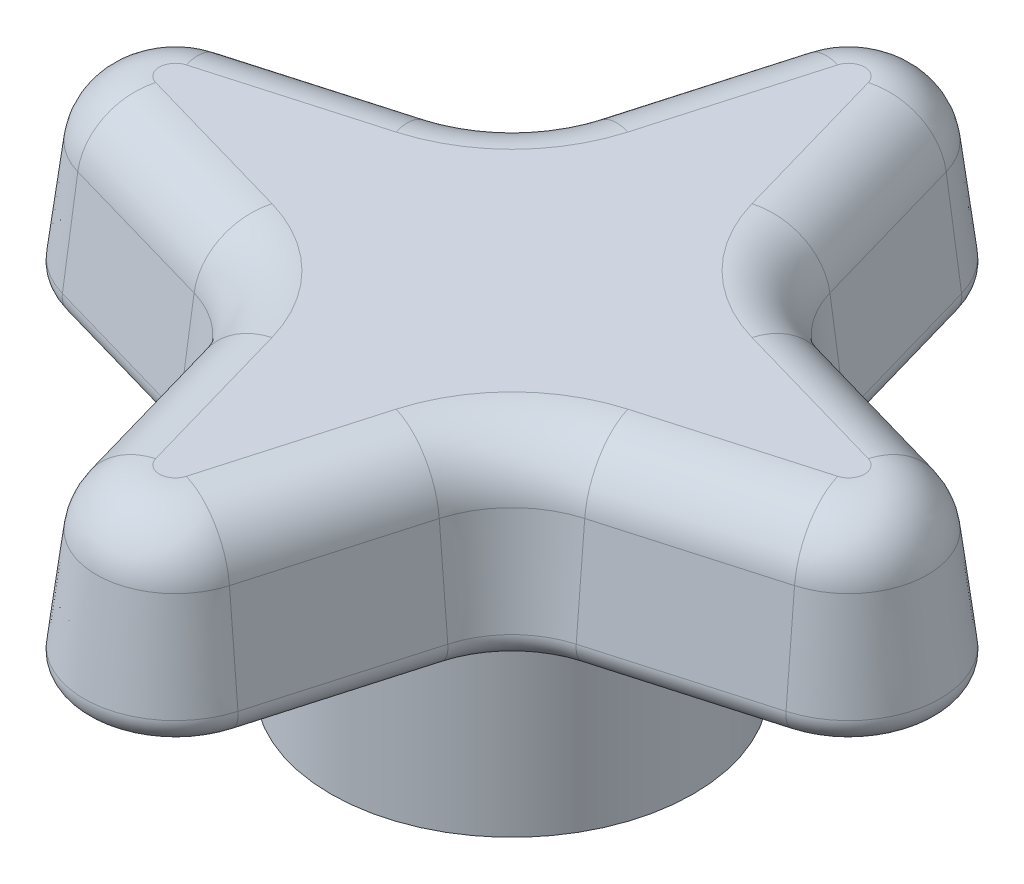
ISO-10303-21;
HEADER;
FILE_DESCRIPTION(('STEP AP214'),'2;1');
FILE_NAME('part.step','',(''),(''),'','','');
FILE_SCHEMA(('AUTOMOTIVE_DESIGN { 1 0 10303 214 1 1 1 1 }'));
ENDSEC;
DATA;
#1=APPLICATION_CONTEXT('core data for automotive mechanical design processes');
#2=APPLICATION_PROTOCOL_DEFINITION('international standard','automotive_design',2000,#1);
#3=PRODUCT_CONTEXT('',#1,'mechanical');
#4=PRODUCT('Part','Part','',(#3));
#5=PRODUCT_RELATED_PRODUCT_CATEGORY('part','',(#4));
#6=PRODUCT_DEFINITION_FORMATION('','',#4);
#7=PRODUCT_DEFINITION_CONTEXT('part definition',#1,'design');
#8=PRODUCT_DEFINITION('design','',#6,#7);
#9=PRODUCT_DEFINITION_SHAPE('','',#8);
#10=(LENGTH_UNIT() NAMED_UNIT(*) SI_UNIT(.MILLI.,.METRE.));
#11=(NAMED_UNIT(*) PLANE_ANGLE_UNIT() SI_UNIT($,.RADIAN.));
#12=(NAMED_UNIT(*) SI_UNIT($,.STERADIAN.) SOLID_ANGLE_UNIT());
#13=UNCERTAINTY_MEASURE_WITH_UNIT(LENGTH_MEASURE(1.E-05),#10,'distance_accuracy_value','');
#14=(GEOMETRIC_REPRESENTATION_CONTEXT(3) GLOBAL_UNCERTAINTY_ASSIGNED_CONTEXT((#13)) GLOBAL_UNIT_ASSIGNED_CONTEXT((#10,
#11,#12)) REPRESENTATION_CONTEXT('',''));
#15=CARTESIAN_POINT('',(0.,0.,0.));
#16=DIRECTION('',(0.,0.,1.));
#17=DIRECTION('',(1.,0.,0.));
#18=AXIS2_PLACEMENT_3D('',#15,#16,#17);
#19=CARTESIAN_POINT('',(0.,0.,-11.7895834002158));
#20=DIRECTION('',(0.,-1.,0.));
#21=DIRECTION('',(0.,0.,-1.));
#22=AXIS2_PLACEMENT_3D('',#19,#20,#21);
#23=PLANE('',#22);
#24=DIRECTION('',(-0.275637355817,0.,-0.961261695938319));
#25=VECTOR('',#24,1.);
#26=CARTESIAN_POINT('',(-3.98458072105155,0.,6.75195549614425));
#27=LINE('',#26,#25);
#28=CARTESIAN_POINT('',(-2.34708037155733,0.,12.4625978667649));
#29=VERTEX_POINT('',#28);
#30=CARTESIAN_POINT('',(-3.98458072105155,0.,6.75195549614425));
#31=VERTEX_POINT('',#30);
#32=EDGE_CURVE('E306',#29,#31,#27,.T.);
#33=ORIENTED_EDGE('',*,*,#32,.T.);
#34=CARTESIAN_POINT('',(-7.86450623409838,0.,7.8645062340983));
#35=DIRECTION('',(0.,-1.,0.));
#36=DIRECTION('',(0.,0.,-1.));
#37=AXIS2_PLACEMENT_3D('',#34,#35,#36);
#38=CIRCLE('',#37,4.03628432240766);
#39=CARTESIAN_POINT('',(-6.75195549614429,0.,3.98458072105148));
#40=VERTEX_POINT('',#39);
#41=EDGE_CURVE('E336',#31,#40,#38,.F.);
#42=ORIENTED_EDGE('',*,*,#41,.T.);
#43=DIRECTION('',(-0.961261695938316,0.,-0.27563735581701));
#44=VECTOR('',#43,1.);
#45=CARTESIAN_POINT('',(-12.4625978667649,0.,2.3470803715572));
#46=LINE('',#45,#44);
#47=CARTESIAN_POINT('',(-12.4625978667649,0.,2.3470803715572));
#48=VERTEX_POINT('',#47);
#49=EDGE_CURVE('E334',#40,#48,#46,.T.);
#50=ORIENTED_EDGE('',*,*,#49,.T.);
#51=CARTESIAN_POINT('',(-11.7895834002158,0.,0.));
#52=DIRECTION('',(0.,-1.,0.));
#53=DIRECTION('',(0.,0.,-1.));
#54=AXIS2_PLACEMENT_3D('',#51,#52,#53);
#55=CIRCLE('',#54,2.4416663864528);
#56=CARTESIAN_POINT('',(-12.4625978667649,0.,-2.3470803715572));
#57=VERTEX_POINT('',#56);
#58=EDGE_CURVE('E332',#48,#57,#55,.T.);
#59=ORIENTED_EDGE('',*,*,#58,.T.);
#60=DIRECTION('',(0.961261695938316,0.,-0.27563735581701));
#61=VECTOR('',#60,1.);
#62=CARTESIAN_POINT('',(-6.75195549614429,0.,-3.98458072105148));
#63=LINE('',#62,#61);
#64=CARTESIAN_POINT('',(-6.75195549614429,0.,-3.98458072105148));
#65=VERTEX_POINT('',#64);
#66=EDGE_CURVE('E330',#57,#65,#63,.T.);
#67=ORIENTED_EDGE('',*,*,#66,.T.);
#68=CARTESIAN_POINT('',(-7.86450623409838,0.,-7.8645062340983));
#69=DIRECTION('',(0.,-1.,0.));
#70=DIRECTION('',(0.,0.,-1.));
#71=AXIS2_PLACEMENT_3D('',#68,#69,#70);
#72=CIRCLE('',#71,4.03628432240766);
#73=CARTESIAN_POINT('',(-3.98458072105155,0.,-6.75195549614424));
#74=VERTEX_POINT('',#73);
#75=EDGE_CURVE('E328',#65,#74,#72,.F.);
#76=ORIENTED_EDGE('',*,*,#75,.T.);
#77=DIRECTION('',(0.275637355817,0.,-0.961261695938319));
#78=VECTOR('',#77,1.);
#79=CARTESIAN_POINT('',(-2.34708037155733,0.,-12.4625978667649));
#80=LINE('',#79,#78);
#81=CARTESIAN_POINT('',(-2.34708037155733,0.,-12.4625978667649));
#82=VERTEX_POINT('',#81);
#83=EDGE_CURVE('E326',#74,#82,#80,.T.);
#84=ORIENTED_EDGE('',*,*,#83,.T.);
#85=CARTESIAN_POINT('',(0.,0.,-11.7895834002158));
#86=DIRECTION('',(0.,-1.,0.));
#87=DIRECTION('',(0.,0.,-1.));
#88=AXIS2_PLACEMENT_3D('',#85,#86,#87);
#89=CIRCLE('',#88,2.44166638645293);
#90=CARTESIAN_POINT('',(2.34708037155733,0.,-12.4625978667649));
#91=VERTEX_POINT('',#90);
#92=EDGE_CURVE('E324',#82,#91,#89,.T.);
#93=ORIENTED_EDGE('',*,*,#92,.T.);
#94=DIRECTION('',(0.275637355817,0.,0.961261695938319));
#95=VECTOR('',#94,1.);
#96=CARTESIAN_POINT('',(3.98458072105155,0.,-6.75195549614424));
#97=LINE('',#96,#95);
#98=CARTESIAN_POINT('',(3.98458072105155,0.,-6.75195549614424));
#99=VERTEX_POINT('',#98);
#100=EDGE_CURVE('E322',#91,#99,#97,.T.);
#101=ORIENTED_EDGE('',*,*,#100,.T.);
#102=CARTESIAN_POINT('',(7.86450623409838,0.,-7.8645062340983));
#103=DIRECTION('',(0.,-1.,0.));
#104=DIRECTION('',(0.,0.,-1.));
#105=AXIS2_PLACEMENT_3D('',#102,#103,#104);
#106=CIRCLE('',#105,4.03628432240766);
#107=CARTESIAN_POINT('',(6.75195549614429,0.,-3.98458072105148));
#108=VERTEX_POINT('',#107);
#109=EDGE_CURVE('E320',#99,#108,#106,.F.);
#110=ORIENTED_EDGE('',*,*,#109,.T.);
#111=DIRECTION('',(0.961261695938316,0.,0.27563735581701));
#112=VECTOR('',#111,1.);
#113=CARTESIAN_POINT('',(12.4625978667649,0.,-2.3470803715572));
#114=LINE('',#113,#112);
#115=CARTESIAN_POINT('',(12.4625978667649,0.,-2.3470803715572));
#116=VERTEX_POINT('',#115);
#117=EDGE_CURVE('E318',#108,#116,#114,.T.);
#118=ORIENTED_EDGE('',*,*,#117,.T.);
#119=CARTESIAN_POINT('',(11.7895834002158,0.,0.));
#120=DIRECTION('',(0.,-1.,0.));
#121=DIRECTION('',(0.,0.,-1.));
#122=AXIS2_PLACEMENT_3D('',#119,#120,#121);
#123=CIRCLE('',#122,2.4416663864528);
#124=CARTESIAN_POINT('',(12.4625978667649,0.,2.3470803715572));
#125=VERTEX_POINT('',#124);
#126=EDGE_CURVE('E316',#116,#125,#123,.T.);
#127=ORIENTED_EDGE('',*,*,#126,.T.);
#128=DIRECTION('',(-0.961261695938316,0.,0.27563735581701));
#129=VECTOR('',#128,1.);
#130=CARTESIAN_POINT('',(6.75195549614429,0.,3.98458072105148));
#131=LINE('',#130,#129);
#132=CARTESIAN_POINT('',(6.75195549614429,0.,3.98458072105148));
#133=VERTEX_POINT('',#132);
#134=EDGE_CURVE('E314',#125,#133,#131,.T.);
#135=ORIENTED_EDGE('',*,*,#134,.T.);
#136=CARTESIAN_POINT('',(7.86450623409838,0.,7.8645062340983));
#137=DIRECTION('',(0.,-1.,0.));
#138=DIRECTION('',(0.,0.,-1.));
#139=AXIS2_PLACEMENT_3D('',#136,#137,#138);
#140=CIRCLE('',#139,4.03628432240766);
#141=CARTESIAN_POINT('',(3.98458072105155,0.,6.75195549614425));
#142=VERTEX_POINT('',#141);
#143=EDGE_CURVE('E312',#133,#142,#140,.F.);
#144=ORIENTED_EDGE('',*,*,#143,.T.);
#145=DIRECTION('',(-0.275637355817,0.,0.961261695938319));
#146=VECTOR('',#145,1.);
#147=CARTESIAN_POINT('',(2.34708037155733,0.,12.4625978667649));
#148=LINE('',#147,#146);
#149=CARTESIAN_POINT('',(2.34708037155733,0.,12.4625978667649));
#150=VERTEX_POINT('',#149);
#151=EDGE_CURVE('E310',#142,#150,#148,.T.);
#152=ORIENTED_EDGE('',*,*,#151,.T.);
#153=CARTESIAN_POINT('',(0.,0.,11.7895834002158));
#154=DIRECTION('',(0.,-1.,0.));
#155=DIRECTION('',(0.,0.,-1.));
#156=AXIS2_PLACEMENT_3D('',#153,#154,#155);
#157=CIRCLE('',#156,2.44166638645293);
#158=EDGE_CURVE('E308',#150,#29,#157,.T.);
#159=ORIENTED_EDGE('',*,*,#158,.T.);
#160=EDGE_LOOP('',(#33,#42,#50,#59,#67,#76,#84,#93,#101,#110,#118,#127,#135,#144,#152,#159));
#161=FACE_BOUND('',#160,.T.);
#162=CARTESIAN_POINT('',(0.,0.,0.));
#163=DIRECTION('',(0.,-1.,0.));
#164=DIRECTION('',(0.,0.,-1.));
#165=AXIS2_PLACEMENT_3D('',#162,#163,#164);
#166=CIRCLE('',#165,6.35);
#167=CARTESIAN_POINT('',(0.,0.,-6.35));
#168=VERTEX_POINT('',#167);
#169=EDGE_CURVE('E427',#168,#168,#166,.T.);
#170=ORIENTED_EDGE('',*,*,#169,.F.);
#171=EDGE_LOOP('',(#170));
#172=FACE_BOUND('',#171,.T.);
#173=ADVANCED_FACE('F28',(#161,#172),#23,.T.);
#174=CARTESIAN_POINT('',(0.,0.,-11.7895834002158));
#175=DIRECTION('',(0.,-1.,0.));
#176=DIRECTION('',(0.,0.,-1.));
#177=AXIS2_PLACEMENT_3D('',#174,#175,#176);
#178=CONICAL_SURFACE('',#177,3.30295070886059,0.122173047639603);
#179=DIRECTION('',(0.117148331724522,-0.992546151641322,-0.0335917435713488));
#180=VECTOR('',#179,1.);
#181=CARTESIAN_POINT('',(3.175,0.,-12.7));
#182=LINE('',#181,#180);
#183=CARTESIAN_POINT('',(2.65587058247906,4.39835461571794,-12.5511420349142));
#184=VERTEX_POINT('',#183);
#185=CARTESIAN_POINT('',(3.07410197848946,0.854864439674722,-12.6710679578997));
#186=VERTEX_POINT('',#185);
#187=EDGE_CURVE('E473',#184,#186,#182,.T.);
#188=ORIENTED_EDGE('',*,*,#187,.T.);
#189=CARTESIAN_POINT('',(0.,0.854864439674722,-11.7895834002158));
#190=DIRECTION('',(0.,-1.,0.));
#191=DIRECTION('',(0.,0.,-1.));
#192=AXIS2_PLACEMENT_3D('',#189,#190,#191);
#193=CIRCLE('',#192,3.19798655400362);
#194=CARTESIAN_POINT('',(-3.07410197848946,0.854864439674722,-12.6710679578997));
#195=VERTEX_POINT('',#194);
#196=EDGE_CURVE('E349',#186,#195,#193,.F.);
#197=ORIENTED_EDGE('',*,*,#196,.T.);
#198=DIRECTION('',(-0.117148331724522,-0.992546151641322,-0.0335917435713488));
#199=VECTOR('',#198,1.);
#200=CARTESIAN_POINT('',(-3.175,0.,-12.7));
#201=LINE('',#200,#199);
#202=CARTESIAN_POINT('',(-2.65587058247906,4.39835461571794,-12.5511420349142));
#203=VERTEX_POINT('',#202);
#204=EDGE_CURVE('E258',#203,#195,#201,.T.);
#205=ORIENTED_EDGE('',*,*,#204,.F.);
#206=CARTESIAN_POINT('',(0.,4.39835461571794,-11.7895834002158));
#207=DIRECTION('',(0.,1.,0.));
#208=DIRECTION('',(0.,0.,1.));
#209=AXIS2_PLACEMENT_3D('',#206,#207,#208);
#210=CIRCLE('',#209,2.76290066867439);
#211=EDGE_CURVE('E288',#203,#184,#210,.F.);
#212=ORIENTED_EDGE('',*,*,#211,.T.);
#213=EDGE_LOOP('',(#188,#197,#205,#212));
#214=FACE_BOUND('',#213,.T.);
#215=ADVANCED_FACE('F689',(#214),#178,.T.);
#216=CARTESIAN_POINT('',(-3.175,0.,-12.7));
#217=DIRECTION('',(-0.954096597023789,0.121869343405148,-0.273582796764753));
#218=DIRECTION('',(-0.275637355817,0.,0.961261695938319));
#219=AXIS2_PLACEMENT_3D('',#216,#217,#218);
#220=PLANE('',#219);
#221=ORIENTED_EDGE('',*,*,#204,.T.);
#222=DIRECTION('',(-0.275637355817,0.,0.961261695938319));
#223=VECTOR('',#222,1.);
#224=CARTESIAN_POINT('',(-4.71160232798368,0.854864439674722,-6.96042558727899));
#225=LINE('',#224,#223);
#226=CARTESIAN_POINT('',(-4.71160232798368,0.854864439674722,-6.96042558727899));
#227=VERTEX_POINT('',#226);
#228=EDGE_CURVE('E347',#195,#227,#225,.T.);
#229=ORIENTED_EDGE('',*,*,#228,.T.);
#230=DIRECTION('',(-0.117148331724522,-0.992546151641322,-0.0335917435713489));
#231=VECTOR('',#230,1.);
#232=CARTESIAN_POINT('',(-4.81250034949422,0.,-6.98935762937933));
#233=LINE('',#232,#231);
#234=CARTESIAN_POINT('',(-4.29337093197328,4.39835461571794,-6.84049966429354));
#235=VERTEX_POINT('',#234);
#236=EDGE_CURVE('E476',#235,#227,#233,.T.);
#237=ORIENTED_EDGE('',*,*,#236,.F.);
#238=DIRECTION('',(-0.275637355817,0.,0.961261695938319));
#239=VECTOR('',#238,1.);
#240=CARTESIAN_POINT('',(-2.65587058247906,4.39835461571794,-12.5511420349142));
#241=LINE('',#240,#239);
#242=EDGE_CURVE('E286',#235,#203,#241,.F.);
#243=ORIENTED_EDGE('',*,*,#242,.T.);
#244=EDGE_LOOP('',(#221,#229,#237,#243));
#245=FACE_BOUND('',#244,.T.);
#246=ADVANCED_FACE('F30',(#245),#220,.T.);
#247=CARTESIAN_POINT('',(-7.86450623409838,0.,-7.8645062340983));
#248=DIRECTION('',(0.,1.,0.));
#249=DIRECTION('',(0.,0.,-1.));
#250=AXIS2_PLACEMENT_3D('',#247,#248,#249);
#251=CONICAL_SURFACE('',#250,3.175,0.122173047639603);
#252=ORIENTED_EDGE('',*,*,#236,.T.);
#253=CARTESIAN_POINT('',(-7.86450623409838,0.854864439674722,-7.8645062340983));
#254=DIRECTION('',(0.,1.,0.));
#255=DIRECTION('',(0.,0.,1.));
#256=AXIS2_PLACEMENT_3D('',#253,#254,#255);
#257=CIRCLE('',#256,3.27996415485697);
#258=CARTESIAN_POINT('',(-6.96042558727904,0.854864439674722,-4.7116023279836));
#259=VERTEX_POINT('',#258);
#260=EDGE_CURVE('E345',#227,#259,#257,.F.);
#261=ORIENTED_EDGE('',*,*,#260,.T.);
#262=DIRECTION('',(-0.0335917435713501,-0.992546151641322,-0.117148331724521));
#263=VECTOR('',#262,1.);
#264=CARTESIAN_POINT('',(-6.98935762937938,0.,-4.81250034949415));
#265=LINE('',#264,#263);
#266=CARTESIAN_POINT('',(-6.84049966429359,4.39835461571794,-4.29337093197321));
#267=VERTEX_POINT('',#266);
#268=EDGE_CURVE('E506',#267,#259,#265,.T.);
#269=ORIENTED_EDGE('',*,*,#268,.F.);
#270=CARTESIAN_POINT('',(-7.86450623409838,4.39835461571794,-7.8645062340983));
#271=DIRECTION('',(0.,-1.,0.));
#272=DIRECTION('',(0.,0.,-1.));
#273=AXIS2_PLACEMENT_3D('',#270,#271,#272);
#274=CIRCLE('',#273,3.71505004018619);
#275=EDGE_CURVE('E284',#267,#235,#274,.F.);
#276=ORIENTED_EDGE('',*,*,#275,.T.);
#277=EDGE_LOOP('',(#252,#261,#269,#276));
#278=FACE_BOUND('',#277,.T.);
#279=ADVANCED_FACE('F594',(#278),#251,.F.);
#280=CARTESIAN_POINT('',(-12.7,0.,-3.17499999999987));
#281=DIRECTION('',(-0.273582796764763,0.121869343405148,-0.954096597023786));
#282=DIRECTION('',(-0.961261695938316,0.,0.27563735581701));
#283=AXIS2_PLACEMENT_3D('',#280,#281,#282);
#284=PLANE('',#283);
#285=ORIENTED_EDGE('',*,*,#268,.T.);
#286=DIRECTION('',(-0.961261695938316,0.,0.27563735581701));
#287=VECTOR('',#286,1.);
#288=CARTESIAN_POINT('',(-12.6710679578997,0.854864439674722,-3.07410197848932));
#289=LINE('',#288,#287);
#290=CARTESIAN_POINT('',(-12.6710679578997,0.854864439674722,-3.07410197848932));
#291=VERTEX_POINT('',#290);
#292=EDGE_CURVE('E343',#259,#291,#289,.T.);
#293=ORIENTED_EDGE('',*,*,#292,.T.);
#294=DIRECTION('',(-0.0335917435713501,-0.992546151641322,-0.117148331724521));
#295=VECTOR('',#294,1.);
#296=CARTESIAN_POINT('',(-12.7,0.,-3.17499999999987));
#297=LINE('',#296,#295);
#298=CARTESIAN_POINT('',(-12.5511420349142,4.39835461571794,-2.65587058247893));
#299=VERTEX_POINT('',#298);
#300=EDGE_CURVE('E503',#299,#291,#297,.T.);
#301=ORIENTED_EDGE('',*,*,#300,.F.);
#302=DIRECTION('',(-0.961261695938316,0.,0.27563735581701));
#303=VECTOR('',#302,1.);
#304=CARTESIAN_POINT('',(-12.5511420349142,4.39835461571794,-2.65587058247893));
#305=LINE('',#304,#303);
#306=EDGE_CURVE('E282',#299,#267,#305,.F.);
#307=ORIENTED_EDGE('',*,*,#306,.T.);
#308=EDGE_LOOP('',(#285,#293,#301,#307));
#309=FACE_BOUND('',#308,.T.);
#310=ADVANCED_FACE('F579',(#309),#284,.T.);
#311=CARTESIAN_POINT('',(-11.7895834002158,0.,0.));
#312=DIRECTION('',(0.,-1.,0.));
#313=DIRECTION('',(0.,0.,1.));
#314=AXIS2_PLACEMENT_3D('',#311,#312,#313);
#315=CONICAL_SURFACE('',#314,3.30295070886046,0.122173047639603);
#316=ORIENTED_EDGE('',*,*,#300,.T.);
#317=CARTESIAN_POINT('',(-11.7895834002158,0.854864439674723,0.));
#318=DIRECTION('',(0.,-1.,0.));
#319=DIRECTION('',(0.,0.,-1.));
#320=AXIS2_PLACEMENT_3D('',#317,#318,#319);
#321=CIRCLE('',#320,3.19798655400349);
#322=CARTESIAN_POINT('',(-12.6710679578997,0.854864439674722,3.07410197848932));
#323=VERTEX_POINT('',#322);
#324=EDGE_CURVE('E341',#291,#323,#321,.F.);
#325=ORIENTED_EDGE('',*,*,#324,.T.);
#326=DIRECTION('',(-0.0335917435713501,-0.992546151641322,0.117148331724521));
#327=VECTOR('',#326,1.);
#328=CARTESIAN_POINT('',(-12.7,0.,3.17499999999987));
#329=LINE('',#328,#327);
#330=CARTESIAN_POINT('',(-12.5511420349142,4.39835461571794,2.65587058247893));
#331=VERTEX_POINT('',#330);
#332=EDGE_CURVE('E500',#331,#323,#329,.T.);
#333=ORIENTED_EDGE('',*,*,#332,.F.);
#334=CARTESIAN_POINT('',(-11.7895834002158,4.39835461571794,0.));
#335=DIRECTION('',(0.,1.,0.));
#336=DIRECTION('',(0.,0.,1.));
#337=AXIS2_PLACEMENT_3D('',#334,#335,#336);
#338=CIRCLE('',#337,2.76290066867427);
#339=EDGE_CURVE('E280',#331,#299,#338,.F.);
#340=ORIENTED_EDGE('',*,*,#339,.T.);
#341=EDGE_LOOP('',(#316,#325,#333,#340));
#342=FACE_BOUND('',#341,.T.);
#343=ADVANCED_FACE('F575',(#342),#315,.T.);
#344=CARTESIAN_POINT('',(-12.7,0.,3.17499999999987));
#345=DIRECTION('',(-0.273582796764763,0.121869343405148,0.954096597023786));
#346=DIRECTION('',(0.961261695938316,0.,0.27563735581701));
#347=AXIS2_PLACEMENT_3D('',#344,#345,#346);
#348=PLANE('',#347);
#349=ORIENTED_EDGE('',*,*,#332,.T.);
#350=DIRECTION('',(0.961261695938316,0.,0.27563735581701));
#351=VECTOR('',#350,1.);
#352=CARTESIAN_POINT('',(-6.96042558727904,0.854864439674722,4.7116023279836));
#353=LINE('',#352,#351);
#354=CARTESIAN_POINT('',(-6.96042558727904,0.854864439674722,4.71160232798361));
#355=VERTEX_POINT('',#354);
#356=EDGE_CURVE('E339',#323,#355,#353,.T.);
#357=ORIENTED_EDGE('',*,*,#356,.T.);
#358=DIRECTION('',(-0.0335917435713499,-0.992546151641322,0.117148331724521));
#359=VECTOR('',#358,1.);
#360=CARTESIAN_POINT('',(-6.98935762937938,0.,4.81250034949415));
#361=LINE('',#360,#359);
#362=CARTESIAN_POINT('',(-6.84049966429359,4.39835461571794,4.29337093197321));
#363=VERTEX_POINT('',#362);
#364=EDGE_CURVE('E497',#363,#355,#361,.T.);
#365=ORIENTED_EDGE('',*,*,#364,.F.);
#366=DIRECTION('',(0.961261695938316,0.,0.27563735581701));
#367=VECTOR('',#366,1.);
#368=CARTESIAN_POINT('',(-12.5511420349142,4.39835461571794,2.65587058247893));
#369=LINE('',#368,#367);
#370=EDGE_CURVE('E278',#363,#331,#369,.F.);
#371=ORIENTED_EDGE('',*,*,#370,.T.);
#372=EDGE_LOOP('',(#349,#357,#365,#371));
#373=FACE_BOUND('',#372,.T.);
#374=ADVANCED_FACE('F561',(#373),#348,.T.);
#375=CARTESIAN_POINT('',(-7.86450623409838,0.,7.8645062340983));
#376=DIRECTION('',(0.,1.,0.));
#377=DIRECTION('',(0.,0.,1.));
#378=AXIS2_PLACEMENT_3D('',#375,#376,#377);
#379=CONICAL_SURFACE('',#378,3.175,0.122173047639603);
#380=ORIENTED_EDGE('',*,*,#364,.T.);
#381=CARTESIAN_POINT('',(-7.86450623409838,0.854864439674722,7.8645062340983));
#382=DIRECTION('',(0.,1.,0.));
#383=DIRECTION('',(0.,0.,1.));
#384=AXIS2_PLACEMENT_3D('',#381,#382,#383);
#385=CIRCLE('',#384,3.27996415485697);
#386=CARTESIAN_POINT('',(-4.71160232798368,0.854864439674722,6.96042558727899));
#387=VERTEX_POINT('',#386);
#388=EDGE_CURVE('E303',#355,#387,#385,.F.);
#389=ORIENTED_EDGE('',*,*,#388,.T.);
#390=DIRECTION('',(-0.117148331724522,-0.992546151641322,0.0335917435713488));
#391=VECTOR('',#390,1.);
#392=CARTESIAN_POINT('',(-4.81250034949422,0.,6.98935762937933));
#393=LINE('',#392,#391);
#394=CARTESIAN_POINT('',(-4.29337093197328,4.39835461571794,6.84049966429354));
#395=VERTEX_POINT('',#394);
#396=EDGE_CURVE('E495',#395,#387,#393,.T.);
#397=ORIENTED_EDGE('',*,*,#396,.F.);
#398=CARTESIAN_POINT('',(-7.86450623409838,4.39835461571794,7.8645062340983));
#399=DIRECTION('',(0.,-1.,0.));
#400=DIRECTION('',(0.,0.,-1.));
#401=AXIS2_PLACEMENT_3D('',#398,#399,#400);
#402=CIRCLE('',#401,3.71505004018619);
#403=EDGE_CURVE('E276',#395,#363,#402,.F.);
#404=ORIENTED_EDGE('',*,*,#403,.T.);
#405=EDGE_LOOP('',(#380,#389,#397,#404));
#406=FACE_BOUND('',#405,.T.);
#407=ADVANCED_FACE('F557',(#406),#379,.F.);
#408=CARTESIAN_POINT('',(-3.175,0.,12.7));
#409=DIRECTION('',(-0.954096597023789,0.121869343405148,0.273582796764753));
#410=DIRECTION('',(0.275637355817,0.,0.961261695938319));
#411=AXIS2_PLACEMENT_3D('',#408,#409,#410);
#412=PLANE('',#411);
#413=ORIENTED_EDGE('',*,*,#396,.T.);
#414=DIRECTION('',(0.275637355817,0.,0.961261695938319));
#415=VECTOR('',#414,1.);
#416=CARTESIAN_POINT('',(-3.07410197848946,0.854864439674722,12.6710679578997));
#417=LINE('',#416,#415);
#418=CARTESIAN_POINT('',(-3.07410197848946,0.854864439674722,12.6710679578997));
#419=VERTEX_POINT('',#418);
#420=EDGE_CURVE('E11',#387,#419,#417,.T.);
#421=ORIENTED_EDGE('',*,*,#420,.T.);
#422=DIRECTION('',(-0.117148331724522,-0.992546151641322,0.0335917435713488));
#423=VECTOR('',#422,1.);
#424=CARTESIAN_POINT('',(-3.175,0.,12.7));
#425=LINE('',#424,#423);
#426=CARTESIAN_POINT('',(-2.65587058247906,4.39835461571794,12.5511420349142));
#427=VERTEX_POINT('',#426);
#428=EDGE_CURVE('E493',#427,#419,#425,.T.);
#429=ORIENTED_EDGE('',*,*,#428,.F.);
#430=DIRECTION('',(0.275637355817,0.,0.961261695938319));
#431=VECTOR('',#430,1.);
#432=CARTESIAN_POINT('',(-2.65587058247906,4.39835461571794,12.5511420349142));
#433=LINE('',#432,#431);
#434=EDGE_CURVE('E274',#427,#395,#433,.F.);
#435=ORIENTED_EDGE('',*,*,#434,.T.);
#436=EDGE_LOOP('',(#413,#421,#429,#435));
#437=FACE_BOUND('',#436,.T.);
#438=ADVANCED_FACE('F545',(#437),#412,.T.);
#439=CARTESIAN_POINT('',(0.,0.,11.7895834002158));
#440=DIRECTION('',(0.,-1.,0.));
#441=DIRECTION('',(0.,0.,1.));
#442=AXIS2_PLACEMENT_3D('',#439,#440,#441);
#443=CONICAL_SURFACE('',#442,3.30295070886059,0.122173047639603);
#444=ORIENTED_EDGE('',*,*,#428,.T.);
#445=CARTESIAN_POINT('',(0.,0.854864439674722,11.7895834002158));
#446=DIRECTION('',(0.,-1.,0.));
#447=DIRECTION('',(0.,0.,-1.));
#448=AXIS2_PLACEMENT_3D('',#445,#446,#447);
#449=CIRCLE('',#448,3.19798655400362);
#450=CARTESIAN_POINT('',(3.07410197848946,0.854864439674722,12.6710679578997));
#451=VERTEX_POINT('',#450);
#452=EDGE_CURVE('E36',#419,#451,#449,.F.);
#453=ORIENTED_EDGE('',*,*,#452,.T.);
#454=DIRECTION('',(0.117148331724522,-0.992546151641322,0.0335917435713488));
#455=VECTOR('',#454,1.);
#456=CARTESIAN_POINT('',(3.175,0.,12.7));
#457=LINE('',#456,#455);
#458=CARTESIAN_POINT('',(2.65587058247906,4.39835461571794,12.5511420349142));
#459=VERTEX_POINT('',#458);
#460=EDGE_CURVE('E370',#459,#451,#457,.T.);
#461=ORIENTED_EDGE('',*,*,#460,.F.);
#462=CARTESIAN_POINT('',(0.,4.39835461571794,11.7895834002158));
#463=DIRECTION('',(0.,1.,0.));
#464=DIRECTION('',(0.,0.,1.));
#465=AXIS2_PLACEMENT_3D('',#462,#463,#464);
#466=CIRCLE('',#465,2.76290066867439);
#467=EDGE_CURVE('E272',#459,#427,#466,.F.);
#468=ORIENTED_EDGE('',*,*,#467,.T.);
#469=EDGE_LOOP('',(#444,#453,#461,#468));
#470=FACE_BOUND('',#469,.T.);
#471=ADVANCED_FACE('F543',(#470),#443,.T.);
#472=CARTESIAN_POINT('',(3.175,0.,12.7));
#473=DIRECTION('',(0.954096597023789,0.121869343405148,0.273582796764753));
#474=DIRECTION('',(0.275637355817,0.,-0.961261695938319));
#475=AXIS2_PLACEMENT_3D('',#472,#473,#474);
#476=PLANE('',#475);
#477=ORIENTED_EDGE('',*,*,#460,.T.);
#478=DIRECTION('',(0.275637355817,0.,-0.961261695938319));
#479=VECTOR('',#478,1.);
#480=CARTESIAN_POINT('',(4.71160232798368,0.854864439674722,6.96042558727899));
#481=LINE('',#480,#479);
#482=CARTESIAN_POINT('',(4.71160232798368,0.854864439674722,6.96042558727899));
#483=VERTEX_POINT('',#482);
#484=EDGE_CURVE('E363',#451,#483,#481,.T.);
#485=ORIENTED_EDGE('',*,*,#484,.T.);
#486=DIRECTION('',(0.117148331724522,-0.992546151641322,0.0335917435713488));
#487=VECTOR('',#486,1.);
#488=CARTESIAN_POINT('',(4.81250034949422,0.,6.98935762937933));
#489=LINE('',#488,#487);
#490=CARTESIAN_POINT('',(4.29337093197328,4.39835461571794,6.84049966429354));
#491=VERTEX_POINT('',#490);
#492=EDGE_CURVE('E369',#491,#483,#489,.T.);
#493=ORIENTED_EDGE('',*,*,#492,.F.);
#494=DIRECTION('',(0.275637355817,0.,-0.961261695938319));
#495=VECTOR('',#494,1.);
#496=CARTESIAN_POINT('',(2.65587058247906,4.39835461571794,12.5511420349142));
#497=LINE('',#496,#495);
#498=EDGE_CURVE('E265',#491,#459,#497,.F.);
#499=ORIENTED_EDGE('',*,*,#498,.T.);
#500=EDGE_LOOP('',(#477,#485,#493,#499));
#501=FACE_BOUND('',#500,.T.);
#502=ADVANCED_FACE('F368',(#501),#476,.T.);
#503=CARTESIAN_POINT('',(7.86450623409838,0.,7.8645062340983));
#504=DIRECTION('',(0.,1.,0.));
#505=DIRECTION('',(0.,0.,-1.));
#506=AXIS2_PLACEMENT_3D('',#503,#504,#505);
#507=CONICAL_SURFACE('',#506,3.175,0.122173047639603);
#508=ORIENTED_EDGE('',*,*,#492,.T.);
#509=CARTESIAN_POINT('',(7.86450623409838,0.854864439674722,7.8645062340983));
#510=DIRECTION('',(0.,1.,0.));
#511=DIRECTION('',(0.,0.,1.));
#512=AXIS2_PLACEMENT_3D('',#509,#510,#511);
#513=CIRCLE('',#512,3.27996415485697);
#514=CARTESIAN_POINT('',(6.96042558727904,0.854864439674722,4.7116023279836));
#515=VERTEX_POINT('',#514);
#516=EDGE_CURVE('E361',#483,#515,#513,.F.);
#517=ORIENTED_EDGE('',*,*,#516,.T.);
#518=DIRECTION('',(0.0335917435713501,-0.992546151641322,0.117148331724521));
#519=VECTOR('',#518,1.);
#520=CARTESIAN_POINT('',(6.98935762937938,0.,4.81250034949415));
#521=LINE('',#520,#519);
#522=CARTESIAN_POINT('',(6.84049966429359,4.39835461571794,4.29337093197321));
#523=VERTEX_POINT('',#522);
#524=EDGE_CURVE('E380',#523,#515,#521,.T.);
#525=ORIENTED_EDGE('',*,*,#524,.F.);
#526=CARTESIAN_POINT('',(7.86450623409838,4.39835461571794,7.8645062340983));
#527=DIRECTION('',(0.,-1.,0.));
#528=DIRECTION('',(0.,0.,-1.));
#529=AXIS2_PLACEMENT_3D('',#526,#527,#528);
#530=CIRCLE('',#529,3.71505004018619);
#531=EDGE_CURVE('E244',#523,#491,#530,.F.);
#532=ORIENTED_EDGE('',*,*,#531,.T.);
#533=EDGE_LOOP('',(#508,#517,#525,#532));
#534=FACE_BOUND('',#533,.T.);
#535=ADVANCED_FACE('F377',(#534),#507,.F.);
#536=CARTESIAN_POINT('',(12.7,0.,3.17499999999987));
#537=DIRECTION('',(0.273582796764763,0.121869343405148,0.954096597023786));
#538=DIRECTION('',(0.961261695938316,0.,-0.27563735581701));
#539=AXIS2_PLACEMENT_3D('',#536,#537,#538);
#540=PLANE('',#539);
#541=ORIENTED_EDGE('',*,*,#524,.T.);
#542=DIRECTION('',(0.961261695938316,0.,-0.27563735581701));
#543=VECTOR('',#542,1.);
#544=CARTESIAN_POINT('',(12.6710679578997,0.854864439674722,3.07410197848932));
#545=LINE('',#544,#543);
#546=CARTESIAN_POINT('',(12.6710679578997,0.854864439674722,3.07410197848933));
#547=VERTEX_POINT('',#546);
#548=EDGE_CURVE('E359',#515,#547,#545,.T.);
#549=ORIENTED_EDGE('',*,*,#548,.T.);
#550=DIRECTION('',(0.0335917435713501,-0.992546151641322,0.117148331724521));
#551=VECTOR('',#550,1.);
#552=CARTESIAN_POINT('',(12.7,0.,3.17499999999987));
#553=LINE('',#552,#551);
#554=CARTESIAN_POINT('',(12.5511420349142,4.39835461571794,2.65587058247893));
#555=VERTEX_POINT('',#554);
#556=EDGE_CURVE('E488',#555,#547,#553,.T.);
#557=ORIENTED_EDGE('',*,*,#556,.F.);
#558=DIRECTION('',(0.961261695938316,0.,-0.27563735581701));
#559=VECTOR('',#558,1.);
#560=CARTESIAN_POINT('',(12.5511420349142,4.39835461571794,2.65587058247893));
#561=LINE('',#560,#559);
#562=EDGE_CURVE('E298',#555,#523,#561,.F.);
#563=ORIENTED_EDGE('',*,*,#562,.T.);
#564=EDGE_LOOP('',(#541,#549,#557,#563));
#565=FACE_BOUND('',#564,.T.);
#566=ADVANCED_FACE('F651',(#565),#540,.T.);
#567=CARTESIAN_POINT('',(11.7895834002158,0.,0.));
#568=DIRECTION('',(0.,-1.,0.));
#569=DIRECTION('',(0.,0.,1.));
#570=AXIS2_PLACEMENT_3D('',#567,#568,#569);
#571=CONICAL_SURFACE('',#570,3.30295070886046,0.122173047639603);
#572=ORIENTED_EDGE('',*,*,#556,.T.);
#573=CARTESIAN_POINT('',(11.7895834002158,0.854864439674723,0.));
#574=DIRECTION('',(0.,-1.,0.));
#575=DIRECTION('',(0.,0.,-1.));
#576=AXIS2_PLACEMENT_3D('',#573,#574,#575);
#577=CIRCLE('',#576,3.19798655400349);
#578=CARTESIAN_POINT('',(12.6710679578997,0.854864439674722,-3.07410197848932));
#579=VERTEX_POINT('',#578);
#580=EDGE_CURVE('E357',#547,#579,#577,.F.);
#581=ORIENTED_EDGE('',*,*,#580,.T.);
#582=DIRECTION('',(0.0335917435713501,-0.992546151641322,-0.117148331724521));
#583=VECTOR('',#582,1.);
#584=CARTESIAN_POINT('',(12.7,0.,-3.17499999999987));
#585=LINE('',#584,#583);
#586=CARTESIAN_POINT('',(12.5511420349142,4.39835461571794,-2.65587058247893));
#587=VERTEX_POINT('',#586);
#588=EDGE_CURVE('E485',#587,#579,#585,.T.);
#589=ORIENTED_EDGE('',*,*,#588,.F.);
#590=CARTESIAN_POINT('',(11.7895834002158,4.39835461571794,0.));
#591=DIRECTION('',(0.,1.,0.));
#592=DIRECTION('',(0.,0.,1.));
#593=AXIS2_PLACEMENT_3D('',#590,#591,#592);
#594=CIRCLE('',#593,2.76290066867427);
#595=EDGE_CURVE('E296',#587,#555,#594,.F.);
#596=ORIENTED_EDGE('',*,*,#595,.T.);
#597=EDGE_LOOP('',(#572,#581,#589,#596));
#598=FACE_BOUND('',#597,.T.);
#599=ADVANCED_FACE('F654',(#598),#571,.T.);
#600=CARTESIAN_POINT('',(12.7,0.,-3.17499999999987));
#601=DIRECTION('',(0.273582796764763,0.121869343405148,-0.954096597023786));
#602=DIRECTION('',(-0.961261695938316,0.,-0.27563735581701));
#603=AXIS2_PLACEMENT_3D('',#600,#601,#602);
#604=PLANE('',#603);
#605=ORIENTED_EDGE('',*,*,#588,.T.);
#606=DIRECTION('',(-0.961261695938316,0.,-0.27563735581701));
#607=VECTOR('',#606,1.);
#608=CARTESIAN_POINT('',(6.96042558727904,0.854864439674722,-4.7116023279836));
#609=LINE('',#608,#607);
#610=CARTESIAN_POINT('',(6.96042558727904,0.854864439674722,-4.7116023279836));
#611=VERTEX_POINT('',#610);
#612=EDGE_CURVE('E355',#579,#611,#609,.T.);
#613=ORIENTED_EDGE('',*,*,#612,.T.);
#614=DIRECTION('',(0.0335917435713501,-0.992546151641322,-0.117148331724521));
#615=VECTOR('',#614,1.);
#616=CARTESIAN_POINT('',(6.98935762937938,0.,-4.81250034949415));
#617=LINE('',#616,#615);
#618=CARTESIAN_POINT('',(6.84049966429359,4.39835461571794,-4.29337093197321));
#619=VERTEX_POINT('',#618);
#620=EDGE_CURVE('E482',#619,#611,#617,.T.);
#621=ORIENTED_EDGE('',*,*,#620,.F.);
#622=DIRECTION('',(-0.961261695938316,0.,-0.27563735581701));
#623=VECTOR('',#622,1.);
#624=CARTESIAN_POINT('',(12.5511420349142,4.39835461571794,-2.65587058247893));
#625=LINE('',#624,#623);
#626=EDGE_CURVE('E294',#619,#587,#625,.F.);
#627=ORIENTED_EDGE('',*,*,#626,.T.);
#628=EDGE_LOOP('',(#605,#613,#621,#627));
#629=FACE_BOUND('',#628,.T.);
#630=ADVANCED_FACE('F667',(#629),#604,.T.);
#631=CARTESIAN_POINT('',(7.86450623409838,0.,-7.8645062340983));
#632=DIRECTION('',(0.,1.,0.));
#633=DIRECTION('',(0.,0.,1.));
#634=AXIS2_PLACEMENT_3D('',#631,#632,#633);
#635=CONICAL_SURFACE('',#634,3.175,0.122173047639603);
#636=ORIENTED_EDGE('',*,*,#620,.T.);
#637=CARTESIAN_POINT('',(7.86450623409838,0.854864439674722,-7.8645062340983));
#638=DIRECTION('',(0.,1.,0.));
#639=DIRECTION('',(0.,0.,1.));
#640=AXIS2_PLACEMENT_3D('',#637,#638,#639);
#641=CIRCLE('',#640,3.27996415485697);
#642=CARTESIAN_POINT('',(4.71160232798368,0.854864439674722,-6.96042558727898));
#643=VERTEX_POINT('',#642);
#644=EDGE_CURVE('E353',#611,#643,#641,.F.);
#645=ORIENTED_EDGE('',*,*,#644,.T.);
#646=DIRECTION('',(0.117148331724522,-0.992546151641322,-0.0335917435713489));
#647=VECTOR('',#646,1.);
#648=CARTESIAN_POINT('',(4.81250034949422,0.,-6.98935762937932));
#649=LINE('',#648,#647);
#650=CARTESIAN_POINT('',(4.29337093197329,4.39835461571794,-6.84049966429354));
#651=VERTEX_POINT('',#650);
#652=EDGE_CURVE('E479',#651,#643,#649,.T.);
#653=ORIENTED_EDGE('',*,*,#652,.F.);
#654=CARTESIAN_POINT('',(7.86450623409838,4.39835461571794,-7.8645062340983));
#655=DIRECTION('',(0.,-1.,0.));
#656=DIRECTION('',(0.,0.,-1.));
#657=AXIS2_PLACEMENT_3D('',#654,#655,#656);
#658=CIRCLE('',#657,3.71505004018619);
#659=EDGE_CURVE('E292',#651,#619,#658,.F.);
#660=ORIENTED_EDGE('',*,*,#659,.T.);
#661=EDGE_LOOP('',(#636,#645,#653,#660));
#662=FACE_BOUND('',#661,.T.);
#663=ADVANCED_FACE('F671',(#662),#635,.F.);
#664=CARTESIAN_POINT('',(3.175,0.,-12.7));
#665=DIRECTION('',(0.954096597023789,0.121869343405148,-0.273582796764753));
#666=DIRECTION('',(-0.275637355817,0.,-0.961261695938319));
#667=AXIS2_PLACEMENT_3D('',#664,#665,#666);
#668=PLANE('',#667);
#669=ORIENTED_EDGE('',*,*,#652,.T.);
#670=DIRECTION('',(-0.275637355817,0.,-0.961261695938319));
#671=VECTOR('',#670,1.);
#672=CARTESIAN_POINT('',(3.07410197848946,0.854864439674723,-12.6710679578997));
#673=LINE('',#672,#671);
#674=EDGE_CURVE('E351',#643,#186,#673,.T.);
#675=ORIENTED_EDGE('',*,*,#674,.T.);
#676=ORIENTED_EDGE('',*,*,#187,.F.);
#677=DIRECTION('',(-0.275637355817,0.,-0.961261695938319));
#678=VECTOR('',#677,1.);
#679=CARTESIAN_POINT('',(2.65587058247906,4.39835461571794,-12.5511420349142));
#680=LINE('',#679,#678);
#681=EDGE_CURVE('E290',#184,#651,#680,.F.);
#682=ORIENTED_EDGE('',*,*,#681,.T.);
#683=EDGE_LOOP('',(#669,#675,#676,#682));
#684=FACE_BOUND('',#683,.T.);
#685=ADVANCED_FACE('F686',(#684),#668,.T.);
#686=CARTESIAN_POINT('',(0.,6.35,-11.7895834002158));
#687=DIRECTION('',(0.,-1.,0.));
#688=DIRECTION('',(0.,0.,-1.));
#689=AXIS2_PLACEMENT_3D('',#686,#687,#688);
#690=PLANE('',#689);
#691=DIRECTION('',(-0.275637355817,0.,0.961261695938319));
#692=VECTOR('',#691,1.);
#693=CARTESIAN_POINT('',(6.78291825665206,6.35,-9.84461288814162));
#694=LINE('',#693,#692);
#695=CARTESIAN_POINT('',(0.535390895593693,6.35,11.9431042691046));
#696=VERTEX_POINT('',#695);
#697=CARTESIAN_POINT('',(2.17289124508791,6.35,6.23246189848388));
#698=VERTEX_POINT('',#697);
#699=EDGE_CURVE('E262',#696,#698,#694,.F.);
#700=ORIENTED_EDGE('',*,*,#699,.T.);
#701=CARTESIAN_POINT('',(7.86450623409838,6.35,7.8645062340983));
#702=DIRECTION('',(0.,-1.,0.));
#703=DIRECTION('',(0.,0.,-1.));
#704=AXIS2_PLACEMENT_3D('',#701,#702,#703);
#705=CIRCLE('',#704,5.92098386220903);
#706=CARTESIAN_POINT('',(6.23246189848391,6.35,2.17289124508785));
#707=VERTEX_POINT('',#706);
#708=EDGE_CURVE('E242',#698,#707,#705,.T.);
#709=ORIENTED_EDGE('',*,*,#708,.T.);
#710=DIRECTION('',(-0.961261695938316,0.,0.27563735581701));
#711=VECTOR('',#710,1.);
#712=CARTESIAN_POINT('',(4.17300937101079,6.35,2.7634297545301));
#713=LINE('',#712,#711);
#714=CARTESIAN_POINT('',(11.9431042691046,6.35,0.535390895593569));
#715=VERTEX_POINT('',#714);
#716=EDGE_CURVE('E251',#707,#715,#713,.F.);
#717=ORIENTED_EDGE('',*,*,#716,.T.);
#718=CARTESIAN_POINT('',(11.7895834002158,6.35,0.));
#719=DIRECTION('',(0.,-1.,0.));
#720=DIRECTION('',(0.,0.,-1.));
#721=AXIS2_PLACEMENT_3D('',#718,#719,#720);
#722=CIRCLE('',#721,0.556966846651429);
#723=CARTESIAN_POINT('',(11.9431042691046,6.35,-0.535390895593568));
#724=VERTEX_POINT('',#723);
#725=EDGE_CURVE('E257',#715,#724,#722,.F.);
#726=ORIENTED_EDGE('',*,*,#725,.T.);
#727=DIRECTION('',(0.961261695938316,0.,0.27563735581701));
#728=VECTOR('',#727,1.);
#729=CARTESIAN_POINT('',(-2.07451799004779,6.35,-4.55487939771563));
#730=LINE('',#729,#728);
#731=CARTESIAN_POINT('',(6.2324618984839,6.35,-2.17289124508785));
#732=VERTEX_POINT('',#731);
#733=EDGE_CURVE('E512',#724,#732,#730,.F.);
#734=ORIENTED_EDGE('',*,*,#733,.T.);
#735=CARTESIAN_POINT('',(7.86450623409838,6.35,-7.8645062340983));
#736=DIRECTION('',(0.,-1.,0.));
#737=DIRECTION('',(0.,0.,-1.));
#738=AXIS2_PLACEMENT_3D('',#735,#736,#737);
#739=CIRCLE('',#738,5.92098386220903);
#740=CARTESIAN_POINT('',(2.17289124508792,6.35,-6.23246189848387));
#741=VERTEX_POINT('',#740);
#742=EDGE_CURVE('E514',#732,#741,#739,.T.);
#743=ORIENTED_EDGE('',*,*,#742,.T.);
#744=DIRECTION('',(0.275637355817,0.,0.961261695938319));
#745=VECTOR('',#744,1.);
#746=CARTESIAN_POINT('',(0.535390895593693,6.35,-11.9431042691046));
#747=LINE('',#746,#745);
#748=CARTESIAN_POINT('',(0.535390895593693,6.35,-11.9431042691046));
#749=VERTEX_POINT('',#748);
#750=EDGE_CURVE('E516',#741,#749,#747,.F.);
#751=ORIENTED_EDGE('',*,*,#750,.T.);
#752=CARTESIAN_POINT('',(0.,6.35,-11.7895834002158));
#753=DIRECTION('',(0.,-1.,0.));
#754=DIRECTION('',(0.,0.,-1.));
#755=AXIS2_PLACEMENT_3D('',#752,#753,#754);
#756=CIRCLE('',#755,0.556966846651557);
#757=CARTESIAN_POINT('',(-0.535390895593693,6.35,-11.9431042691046));
#758=VERTEX_POINT('',#757);
#759=EDGE_CURVE('E518',#749,#758,#756,.F.);
#760=ORIENTED_EDGE('',*,*,#759,.T.);
#761=DIRECTION('',(0.275637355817,0.,-0.961261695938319));
#762=VECTOR('',#761,1.);
#763=CARTESIAN_POINT('',(-0.535390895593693,6.35,-11.9431042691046));
#764=LINE('',#763,#762);
#765=CARTESIAN_POINT('',(-2.17289124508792,6.35,-6.23246189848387));
#766=VERTEX_POINT('',#765);
#767=EDGE_CURVE('E520',#758,#766,#764,.F.);
#768=ORIENTED_EDGE('',*,*,#767,.T.);
#769=CARTESIAN_POINT('',(-7.86450623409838,6.35,-7.8645062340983));
#770=DIRECTION('',(0.,-1.,0.));
#771=DIRECTION('',(0.,0.,-1.));
#772=AXIS2_PLACEMENT_3D('',#769,#770,#771);
#773=CIRCLE('',#772,5.92098386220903);
#774=CARTESIAN_POINT('',(-6.2324618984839,6.35,-2.17289124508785));
#775=VERTEX_POINT('',#774);
#776=EDGE_CURVE('E522',#766,#775,#773,.T.);
#777=ORIENTED_EDGE('',*,*,#776,.T.);
#778=DIRECTION('',(0.961261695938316,0.,-0.27563735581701));
#779=VECTOR('',#778,1.);
#780=CARTESIAN_POINT('',(2.07451799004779,6.35,-4.55487939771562));
#781=LINE('',#780,#779);
#782=CARTESIAN_POINT('',(-11.9431042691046,6.35,-0.535390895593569));
#783=VERTEX_POINT('',#782);
#784=EDGE_CURVE('E524',#775,#783,#781,.F.);
#785=ORIENTED_EDGE('',*,*,#784,.T.);
#786=CARTESIAN_POINT('',(-11.7895834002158,6.35,0.));
#787=DIRECTION('',(0.,-1.,0.));
#788=DIRECTION('',(0.,0.,-1.));
#789=AXIS2_PLACEMENT_3D('',#786,#787,#788);
#790=CIRCLE('',#789,0.556966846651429);
#791=CARTESIAN_POINT('',(-11.9431042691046,6.35,0.535390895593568));
#792=VERTEX_POINT('',#791);
#793=EDGE_CURVE('E526',#783,#792,#790,.F.);
#794=ORIENTED_EDGE('',*,*,#793,.T.);
#795=DIRECTION('',(-0.961261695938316,0.,-0.27563735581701));
#796=VECTOR('',#795,1.);
#797=CARTESIAN_POINT('',(-4.17300937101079,6.35,2.7634297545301));
#798=LINE('',#797,#796);
#799=CARTESIAN_POINT('',(-6.2324618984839,6.35,2.17289124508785));
#800=VERTEX_POINT('',#799);
#801=EDGE_CURVE('E528',#792,#800,#798,.F.);
#802=ORIENTED_EDGE('',*,*,#801,.T.);
#803=CARTESIAN_POINT('',(-7.86450623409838,6.35,7.8645062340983));
#804=DIRECTION('',(0.,-1.,0.));
#805=DIRECTION('',(0.,0.,-1.));
#806=AXIS2_PLACEMENT_3D('',#803,#804,#805);
#807=CIRCLE('',#806,5.92098386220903);
#808=CARTESIAN_POINT('',(-2.17289124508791,6.35,6.23246189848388));
#809=VERTEX_POINT('',#808);
#810=EDGE_CURVE('E530',#800,#809,#807,.T.);
#811=ORIENTED_EDGE('',*,*,#810,.T.);
#812=DIRECTION('',(-0.275637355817,0.,-0.961261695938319));
#813=VECTOR('',#812,1.);
#814=CARTESIAN_POINT('',(-6.78291825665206,6.35,-9.84461288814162));
#815=LINE('',#814,#813);
#816=CARTESIAN_POINT('',(-0.535390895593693,6.35,11.9431042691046));
#817=VERTEX_POINT('',#816);
#818=EDGE_CURVE('E532',#809,#817,#815,.F.);
#819=ORIENTED_EDGE('',*,*,#818,.T.);
#820=CARTESIAN_POINT('',(0.,6.35,11.7895834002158));
#821=DIRECTION('',(0.,-1.,0.));
#822=DIRECTION('',(0.,0.,-1.));
#823=AXIS2_PLACEMENT_3D('',#820,#821,#822);
#824=CIRCLE('',#823,0.556966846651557);
#825=EDGE_CURVE('E267',#817,#696,#824,.F.);
#826=ORIENTED_EDGE('',*,*,#825,.T.);
#827=EDGE_LOOP('',(#700,#709,#717,#726,#734,#743,#751,#760,#768,#777,#785,#794,#802,#811,#819,#826));
#828=FACE_BOUND('',#827,.T.);
#829=ADVANCED_FACE('F260',(#828),#690,.F.);
#830=CARTESIAN_POINT('',(-7.86450623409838,4.1275,-7.8645062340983));
#831=DIRECTION('',(0.,-1.,0.));
#832=DIRECTION('',(0.,0.,-1.));
#833=AXIS2_PLACEMENT_3D('',#830,#831,#832);
#834=TOROIDAL_SURFACE('',#833,5.92098386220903,2.2225);
#835=CARTESIAN_POINT('',(-2.17289124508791,4.1275,-6.23246189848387));
#836=DIRECTION('',(0.275637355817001,0.,-0.961261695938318));
#837=DIRECTION('',(-0.961261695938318,0.,-0.275637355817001));
#838=AXIS2_PLACEMENT_3D('',#835,#836,#837);
#839=CIRCLE('',#838,2.2225);
#840=EDGE_CURVE('E467',#235,#766,#839,.T.);
#841=ORIENTED_EDGE('',*,*,#840,.F.);
#842=ORIENTED_EDGE('',*,*,#275,.F.);
#843=CARTESIAN_POINT('',(-6.2324618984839,4.1275,-2.17289124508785));
#844=DIRECTION('',(-0.961261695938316,0.,0.275637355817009));
#845=DIRECTION('',(0.27563735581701,0.,0.961261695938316));
#846=AXIS2_PLACEMENT_3D('',#843,#844,#845);
#847=CIRCLE('',#846,2.2225);
#848=EDGE_CURVE('E470',#775,#267,#847,.T.);
#849=ORIENTED_EDGE('',*,*,#848,.F.);
#850=ORIENTED_EDGE('',*,*,#776,.F.);
#851=EDGE_LOOP('',(#841,#842,#849,#850));
#852=FACE_BOUND('',#851,.T.);
#853=ADVANCED_FACE('F590',(#852),#834,.T.);
#854=CARTESIAN_POINT('',(2.07451799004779,4.1275,-4.55487939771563));
#855=DIRECTION('',(0.961261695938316,0.,-0.27563735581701));
#856=DIRECTION('',(-0.27563735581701,0.,-0.961261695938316));
#857=AXIS2_PLACEMENT_3D('',#854,#855,#856);
#858=CYLINDRICAL_SURFACE('',#857,2.2225);
#859=ORIENTED_EDGE('',*,*,#848,.T.);
#860=ORIENTED_EDGE('',*,*,#306,.F.);
#861=CARTESIAN_POINT('',(-11.9431042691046,4.1275,-0.535390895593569));
#862=DIRECTION('',(-0.961261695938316,0.,0.275637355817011));
#863=DIRECTION('',(0.275637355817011,0.,0.961261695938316));
#864=AXIS2_PLACEMENT_3D('',#861,#862,#863);
#865=CIRCLE('',#864,2.2225);
#866=EDGE_CURVE('E464',#783,#299,#865,.T.);
#867=ORIENTED_EDGE('',*,*,#866,.F.);
#868=ORIENTED_EDGE('',*,*,#784,.F.);
#869=EDGE_LOOP('',(#859,#860,#867,#868));
#870=FACE_BOUND('',#869,.T.);
#871=ADVANCED_FACE('F583',(#870),#858,.T.);
#872=CARTESIAN_POINT('',(-0.535390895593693,4.1275,-11.9431042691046));
#873=DIRECTION('',(0.275637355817,0.,-0.961261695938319));
#874=DIRECTION('',(-0.961261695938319,0.,-0.275637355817));
#875=AXIS2_PLACEMENT_3D('',#872,#873,#874);
#876=CYLINDRICAL_SURFACE('',#875,2.2225);
#877=ORIENTED_EDGE('',*,*,#840,.T.);
#878=ORIENTED_EDGE('',*,*,#767,.F.);
#879=CARTESIAN_POINT('',(-0.535390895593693,4.1275,-11.9431042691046));
#880=DIRECTION('',(0.275637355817,0.,-0.961261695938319));
#881=DIRECTION('',(-0.961261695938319,0.,-0.275637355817));
#882=AXIS2_PLACEMENT_3D('',#879,#880,#881);
#883=CIRCLE('',#882,2.2225);
#884=EDGE_CURVE('E461',#203,#758,#883,.T.);
#885=ORIENTED_EDGE('',*,*,#884,.F.);
#886=ORIENTED_EDGE('',*,*,#242,.F.);
#887=EDGE_LOOP('',(#877,#878,#885,#886));
#888=FACE_BOUND('',#887,.T.);
#889=ADVANCED_FACE('F712',(#888),#876,.T.);
#890=CARTESIAN_POINT('',(-11.7895834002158,4.1275,0.));
#891=DIRECTION('',(0.,-1.,0.));
#892=DIRECTION('',(0.,0.,-1.));
#893=AXIS2_PLACEMENT_3D('',#890,#891,#892);
#894=DEGENERATE_TOROIDAL_SURFACE('',#893,0.556966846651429,2.2225,.T.);
#895=ORIENTED_EDGE('',*,*,#866,.T.);
#896=ORIENTED_EDGE('',*,*,#339,.F.);
#897=CARTESIAN_POINT('',(-11.9431042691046,4.1275,0.535390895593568));
#898=DIRECTION('',(0.961261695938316,0.,0.27563735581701));
#899=DIRECTION('',(0.27563735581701,0.,-0.961261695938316));
#900=AXIS2_PLACEMENT_3D('',#897,#898,#899);
#901=CIRCLE('',#900,2.2225);
#902=EDGE_CURVE('E458',#792,#331,#901,.T.);
#903=ORIENTED_EDGE('',*,*,#902,.F.);
#904=ORIENTED_EDGE('',*,*,#793,.F.);
#905=EDGE_LOOP('',(#895,#896,#903,#904));
#906=FACE_BOUND('',#905,.T.);
#907=ADVANCED_FACE('F571',(#906),#894,.T.);
#908=CARTESIAN_POINT('',(0.,4.1275,-11.7895834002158));
#909=DIRECTION('',(0.,-1.,0.));
#910=DIRECTION('',(0.,0.,-1.));
#911=AXIS2_PLACEMENT_3D('',#908,#909,#910);
#912=DEGENERATE_TOROIDAL_SURFACE('',#911,0.556966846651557,2.2225,.T.);
#913=ORIENTED_EDGE('',*,*,#884,.T.);
#914=ORIENTED_EDGE('',*,*,#759,.F.);
#915=CARTESIAN_POINT('',(0.535390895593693,4.1275,-11.9431042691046));
#916=DIRECTION('',(0.275637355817,0.,0.961261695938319));
#917=DIRECTION('',(0.961261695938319,0.,-0.275637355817));
#918=AXIS2_PLACEMENT_3D('',#915,#916,#917);
#919=CIRCLE('',#918,2.2225);
#920=EDGE_CURVE('E455',#184,#749,#919,.T.);
#921=ORIENTED_EDGE('',*,*,#920,.F.);
#922=ORIENTED_EDGE('',*,*,#211,.F.);
#923=EDGE_LOOP('',(#913,#914,#921,#922));
#924=FACE_BOUND('',#923,.T.);
#925=ADVANCED_FACE('F693',(#924),#912,.T.);
#926=CARTESIAN_POINT('',(-4.17300937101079,4.1275,2.7634297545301));
#927=DIRECTION('',(-0.961261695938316,0.,-0.27563735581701));
#928=DIRECTION('',(-0.27563735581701,0.,0.961261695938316));
#929=AXIS2_PLACEMENT_3D('',#926,#927,#928);
#930=CYLINDRICAL_SURFACE('',#929,2.2225);
#931=ORIENTED_EDGE('',*,*,#902,.T.);
#932=ORIENTED_EDGE('',*,*,#370,.F.);
#933=CARTESIAN_POINT('',(-6.2324618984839,4.1275,2.17289124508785));
#934=DIRECTION('',(0.961261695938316,0.,0.275637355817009));
#935=DIRECTION('',(0.275637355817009,0.,-0.961261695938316));
#936=AXIS2_PLACEMENT_3D('',#933,#934,#935);
#937=CIRCLE('',#936,2.2225);
#938=EDGE_CURVE('E452',#800,#363,#937,.T.);
#939=ORIENTED_EDGE('',*,*,#938,.F.);
#940=ORIENTED_EDGE('',*,*,#801,.F.);
#941=EDGE_LOOP('',(#931,#932,#939,#940));
#942=FACE_BOUND('',#941,.T.);
#943=ADVANCED_FACE('F565',(#942),#930,.T.);
#944=CARTESIAN_POINT('',(0.535390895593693,4.1275,-11.9431042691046));
#945=DIRECTION('',(0.275637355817,0.,0.961261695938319));
#946=DIRECTION('',(0.961261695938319,0.,-0.275637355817));
#947=AXIS2_PLACEMENT_3D('',#944,#945,#946);
#948=CYLINDRICAL_SURFACE('',#947,2.2225);
#949=ORIENTED_EDGE('',*,*,#920,.T.);
#950=ORIENTED_EDGE('',*,*,#750,.F.);
#951=CARTESIAN_POINT('',(2.17289124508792,4.1275,-6.23246189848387));
#952=DIRECTION('',(0.275637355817,0.,0.961261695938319));
#953=DIRECTION('',(0.961261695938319,0.,-0.275637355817));
#954=AXIS2_PLACEMENT_3D('',#951,#952,#953);
#955=CIRCLE('',#954,2.2225);
#956=EDGE_CURVE('E449',#651,#741,#955,.T.);
#957=ORIENTED_EDGE('',*,*,#956,.F.);
#958=ORIENTED_EDGE('',*,*,#681,.F.);
#959=EDGE_LOOP('',(#949,#950,#957,#958));
#960=FACE_BOUND('',#959,.T.);
#961=ADVANCED_FACE('F699',(#960),#948,.T.);
#962=CARTESIAN_POINT('',(-7.86450623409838,4.1275,7.8645062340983));
#963=DIRECTION('',(0.,-1.,0.));
#964=DIRECTION('',(0.,0.,-1.));
#965=AXIS2_PLACEMENT_3D('',#962,#963,#964);
#966=TOROIDAL_SURFACE('',#965,5.92098386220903,2.2225);
#967=ORIENTED_EDGE('',*,*,#938,.T.);
#968=ORIENTED_EDGE('',*,*,#403,.F.);
#969=CARTESIAN_POINT('',(-2.17289124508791,4.1275,6.23246189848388));
#970=DIRECTION('',(0.275637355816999,0.,0.961261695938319));
#971=DIRECTION('',(0.961261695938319,0.,-0.275637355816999));
#972=AXIS2_PLACEMENT_3D('',#969,#970,#971);
#973=CIRCLE('',#972,2.2225);
#974=EDGE_CURVE('E446',#809,#395,#973,.T.);
#975=ORIENTED_EDGE('',*,*,#974,.F.);
#976=ORIENTED_EDGE('',*,*,#810,.F.);
#977=EDGE_LOOP('',(#967,#968,#975,#976));
#978=FACE_BOUND('',#977,.T.);
#979=ADVANCED_FACE('F553',(#978),#966,.T.);
#980=CARTESIAN_POINT('',(7.86450623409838,4.1275,-7.8645062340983));
#981=DIRECTION('',(0.,-1.,0.));
#982=DIRECTION('',(0.,0.,-1.));
#983=AXIS2_PLACEMENT_3D('',#980,#981,#982);
#984=TOROIDAL_SURFACE('',#983,5.92098386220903,2.2225);
#985=ORIENTED_EDGE('',*,*,#956,.T.);
#986=ORIENTED_EDGE('',*,*,#742,.F.);
#987=CARTESIAN_POINT('',(6.2324618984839,4.1275,-2.17289124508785));
#988=DIRECTION('',(0.961261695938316,0.,0.27563735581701));
#989=DIRECTION('',(0.27563735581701,0.,-0.961261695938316));
#990=AXIS2_PLACEMENT_3D('',#987,#988,#989);
#991=CIRCLE('',#990,2.2225);
#992=EDGE_CURVE('E443',#619,#732,#991,.T.);
#993=ORIENTED_EDGE('',*,*,#992,.F.);
#994=ORIENTED_EDGE('',*,*,#659,.F.);
#995=EDGE_LOOP('',(#985,#986,#993,#994));
#996=FACE_BOUND('',#995,.T.);
#997=ADVANCED_FACE('F702',(#996),#984,.T.);
#998=CARTESIAN_POINT('',(-6.78291825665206,4.1275,-9.84461288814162));
#999=DIRECTION('',(-0.275637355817,0.,-0.961261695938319));
#1000=DIRECTION('',(-0.961261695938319,0.,0.275637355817));
#1001=AXIS2_PLACEMENT_3D('',#998,#999,#1000);
#1002=CYLINDRICAL_SURFACE('',#1001,2.2225);
#1003=ORIENTED_EDGE('',*,*,#974,.T.);
#1004=ORIENTED_EDGE('',*,*,#434,.F.);
#1005=CARTESIAN_POINT('',(-0.535390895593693,4.1275,11.9431042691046));
#1006=DIRECTION('',(0.275637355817,0.,0.961261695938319));
#1007=DIRECTION('',(0.961261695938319,0.,-0.275637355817));
#1008=AXIS2_PLACEMENT_3D('',#1005,#1006,#1007);
#1009=CIRCLE('',#1008,2.2225);
#1010=EDGE_CURVE('E440',#817,#427,#1009,.T.);
#1011=ORIENTED_EDGE('',*,*,#1010,.F.);
#1012=ORIENTED_EDGE('',*,*,#818,.F.);
#1013=EDGE_LOOP('',(#1003,#1004,#1011,#1012));
#1014=FACE_BOUND('',#1013,.T.);
#1015=ADVANCED_FACE('F548',(#1014),#1002,.T.);
#1016=CARTESIAN_POINT('',(-2.07451799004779,4.1275,-4.55487939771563));
#1017=DIRECTION('',(0.961261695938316,0.,0.27563735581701));
#1018=DIRECTION('',(0.27563735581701,0.,-0.961261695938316));
#1019=AXIS2_PLACEMENT_3D('',#1016,#1017,#1018);
#1020=CYLINDRICAL_SURFACE('',#1019,2.2225);
#1021=ORIENTED_EDGE('',*,*,#992,.T.);
#1022=ORIENTED_EDGE('',*,*,#733,.F.);
#1023=CARTESIAN_POINT('',(11.9431042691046,4.1275,-0.535390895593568));
#1024=DIRECTION('',(0.961261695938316,0.,0.27563735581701));
#1025=DIRECTION('',(0.27563735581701,0.,-0.961261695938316));
#1026=AXIS2_PLACEMENT_3D('',#1023,#1024,#1025);
#1027=CIRCLE('',#1026,2.2225);
#1028=EDGE_CURVE('E437',#587,#724,#1027,.T.);
#1029=ORIENTED_EDGE('',*,*,#1028,.F.);
#1030=ORIENTED_EDGE('',*,*,#626,.F.);
#1031=EDGE_LOOP('',(#1021,#1022,#1029,#1030));
#1032=FACE_BOUND('',#1031,.T.);
#1033=ADVANCED_FACE('F707',(#1032),#1020,.T.);
#1034=CARTESIAN_POINT('',(0.,4.1275,11.7895834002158));
#1035=DIRECTION('',(0.,-1.,0.));
#1036=DIRECTION('',(0.,0.,-1.));
#1037=AXIS2_PLACEMENT_3D('',#1034,#1035,#1036);
#1038=DEGENERATE_TOROIDAL_SURFACE('',#1037,0.556966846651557,2.2225,.T.);
#1039=ORIENTED_EDGE('',*,*,#1010,.T.);
#1040=ORIENTED_EDGE('',*,*,#467,.F.);
#1041=CARTESIAN_POINT('',(0.535390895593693,4.1275,11.9431042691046));
#1042=DIRECTION('',(0.275637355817,0.,-0.961261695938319));
#1043=DIRECTION('',(-0.961261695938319,0.,-0.275637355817));
#1044=AXIS2_PLACEMENT_3D('',#1041,#1042,#1043);
#1045=CIRCLE('',#1044,2.2225);
#1046=EDGE_CURVE('E434',#696,#459,#1045,.T.);
#1047=ORIENTED_EDGE('',*,*,#1046,.F.);
#1048=ORIENTED_EDGE('',*,*,#825,.F.);
#1049=EDGE_LOOP('',(#1039,#1040,#1047,#1048));
#1050=FACE_BOUND('',#1049,.T.);
#1051=ADVANCED_FACE('F539',(#1050),#1038,.T.);
#1052=CARTESIAN_POINT('',(11.7895834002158,4.1275,0.));
#1053=DIRECTION('',(0.,-1.,0.));
#1054=DIRECTION('',(0.,0.,-1.));
#1055=AXIS2_PLACEMENT_3D('',#1052,#1053,#1054);
#1056=DEGENERATE_TOROIDAL_SURFACE('',#1055,0.556966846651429,2.2225,.T.);
#1057=ORIENTED_EDGE('',*,*,#1028,.T.);
#1058=ORIENTED_EDGE('',*,*,#725,.F.);
#1059=CARTESIAN_POINT('',(11.9431042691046,4.1275,0.535390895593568));
#1060=DIRECTION('',(-0.961261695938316,0.,0.275637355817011));
#1061=DIRECTION('',(0.275637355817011,0.,0.961261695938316));
#1062=AXIS2_PLACEMENT_3D('',#1059,#1060,#1061);
#1063=CIRCLE('',#1062,2.2225);
#1064=EDGE_CURVE('E254',#555,#715,#1063,.T.);
#1065=ORIENTED_EDGE('',*,*,#1064,.F.);
#1066=ORIENTED_EDGE('',*,*,#595,.F.);
#1067=EDGE_LOOP('',(#1057,#1058,#1065,#1066));
#1068=FACE_BOUND('',#1067,.T.);
#1069=ADVANCED_FACE('F709',(#1068),#1056,.T.);
#1070=CARTESIAN_POINT('',(6.78291825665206,4.1275,-9.84461288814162));
#1071=DIRECTION('',(-0.275637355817,0.,0.961261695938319));
#1072=DIRECTION('',(0.961261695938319,0.,0.275637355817));
#1073=AXIS2_PLACEMENT_3D('',#1070,#1071,#1072);
#1074=CYLINDRICAL_SURFACE('',#1073,2.2225);
#1075=ORIENTED_EDGE('',*,*,#1046,.T.);
#1076=ORIENTED_EDGE('',*,*,#498,.F.);
#1077=CARTESIAN_POINT('',(2.17289124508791,4.1275,6.23246189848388));
#1078=DIRECTION('',(0.275637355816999,0.,-0.961261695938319));
#1079=DIRECTION('',(-0.961261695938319,0.,-0.275637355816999));
#1080=AXIS2_PLACEMENT_3D('',#1077,#1078,#1079);
#1081=CIRCLE('',#1080,2.2225);
#1082=EDGE_CURVE('E247',#698,#491,#1081,.T.);
#1083=ORIENTED_EDGE('',*,*,#1082,.F.);
#1084=ORIENTED_EDGE('',*,*,#699,.F.);
#1085=EDGE_LOOP('',(#1075,#1076,#1083,#1084));
#1086=FACE_BOUND('',#1085,.T.);
#1087=ADVANCED_FACE('F542',(#1086),#1074,.T.);
#1088=CARTESIAN_POINT('',(4.17300937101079,4.1275,2.7634297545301));
#1089=DIRECTION('',(-0.961261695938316,0.,0.27563735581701));
#1090=DIRECTION('',(0.27563735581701,0.,0.961261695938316));
#1091=AXIS2_PLACEMENT_3D('',#1088,#1089,#1090);
#1092=CYLINDRICAL_SURFACE('',#1091,2.2225);
#1093=ORIENTED_EDGE('',*,*,#1064,.T.);
#1094=ORIENTED_EDGE('',*,*,#716,.F.);
#1095=CARTESIAN_POINT('',(6.2324618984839,4.1275,2.17289124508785));
#1096=DIRECTION('',(-0.961261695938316,0.,0.27563735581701));
#1097=DIRECTION('',(0.27563735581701,0.,0.961261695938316));
#1098=AXIS2_PLACEMENT_3D('',#1095,#1096,#1097);
#1099=CIRCLE('',#1098,2.2225);
#1100=EDGE_CURVE('E238',#523,#707,#1099,.T.);
#1101=ORIENTED_EDGE('',*,*,#1100,.F.);
#1102=ORIENTED_EDGE('',*,*,#562,.F.);
#1103=EDGE_LOOP('',(#1093,#1094,#1101,#1102));
#1104=FACE_BOUND('',#1103,.T.);
#1105=ADVANCED_FACE('F252',(#1104),#1092,.T.);
#1106=CARTESIAN_POINT('',(7.86450623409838,4.1275,7.8645062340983));
#1107=DIRECTION('',(0.,-1.,0.));
#1108=DIRECTION('',(0.,0.,-1.));
#1109=AXIS2_PLACEMENT_3D('',#1106,#1107,#1108);
#1110=TOROIDAL_SURFACE('',#1109,5.92098386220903,2.2225);
#1111=ORIENTED_EDGE('',*,*,#1082,.T.);
#1112=ORIENTED_EDGE('',*,*,#531,.F.);
#1113=ORIENTED_EDGE('',*,*,#1100,.T.);
#1114=ORIENTED_EDGE('',*,*,#708,.F.);
#1115=EDGE_LOOP('',(#1111,#1112,#1113,#1114));
#1116=FACE_BOUND('',#1115,.T.);
#1117=ADVANCED_FACE('F240',(#1116),#1110,.T.);
#1118=CARTESIAN_POINT('',(0.,-6.35,0.));
#1119=DIRECTION('',(0.,-1.,0.));
#1120=DIRECTION('',(0.,0.,-1.));
#1121=AXIS2_PLACEMENT_3D('',#1118,#1119,#1120);
#1122=PLANE('',#1121);
#1123=CARTESIAN_POINT('',(0.,-6.35,0.));
#1124=DIRECTION('',(0.,-1.,0.));
#1125=DIRECTION('',(0.,0.,-1.));
#1126=AXIS2_PLACEMENT_3D('',#1123,#1124,#1125);
#1127=CIRCLE('',#1126,6.35);
#1128=CARTESIAN_POINT('',(0.,-6.35,-6.35));
#1129=VERTEX_POINT('',#1128);
#1130=EDGE_CURVE('E248',#1129,#1129,#1127,.T.);
#1131=ORIENTED_EDGE('',*,*,#1130,.T.);
#1132=EDGE_LOOP('',(#1131));
#1133=FACE_BOUND('',#1132,.T.);
#1134=CARTESIAN_POINT('',(0.,-6.35,0.));
#1135=DIRECTION('',(0.,-1.,0.));
#1136=DIRECTION('',(0.,0.,-1.));
#1137=AXIS2_PLACEMENT_3D('',#1134,#1135,#1136);
#1138=CIRCLE('',#1137,4.92125);
#1139=CARTESIAN_POINT('',(0.,-6.35,-4.92125));
#1140=VERTEX_POINT('',#1139);
#1141=EDGE_CURVE('E424',#1140,#1140,#1138,.T.);
#1142=ORIENTED_EDGE('',*,*,#1141,.F.);
#1143=EDGE_LOOP('',(#1142));
#1144=FACE_BOUND('',#1143,.T.);
#1145=ADVANCED_FACE('F746',(#1133,#1144),#1122,.T.);
#1146=CARTESIAN_POINT('',(0.,-6.35,0.));
#1147=DIRECTION('',(0.,1.,0.));
#1148=DIRECTION('',(0.,0.,1.));
#1149=AXIS2_PLACEMENT_3D('',#1146,#1147,#1148);
#1150=CYLINDRICAL_SURFACE('',#1149,6.35);
#1151=ORIENTED_EDGE('',*,*,#1130,.F.);
#1152=EDGE_LOOP('',(#1151));
#1153=FACE_BOUND('',#1152,.T.);
#1154=ORIENTED_EDGE('',*,*,#169,.T.);
#1155=EDGE_LOOP('',(#1154));
#1156=FACE_BOUND('',#1155,.T.);
#1157=ADVANCED_FACE('F738',(#1153,#1156),#1150,.T.);
#1158=CARTESIAN_POINT('',(0.,-6.35,0.));
#1159=DIRECTION('',(0.,1.,0.));
#1160=DIRECTION('',(0.,0.,1.));
#1161=AXIS2_PLACEMENT_3D('',#1158,#1159,#1160);
#1162=CYLINDRICAL_SURFACE('',#1161,4.92125);
#1163=ORIENTED_EDGE('',*,*,#1141,.T.);
#1164=EDGE_LOOP('',(#1163));
#1165=FACE_BOUND('',#1164,.T.);
#1166=CARTESIAN_POINT('',(0.,0.,0.));
#1167=DIRECTION('',(0.,-1.,0.));
#1168=DIRECTION('',(0.,0.,-1.));
#1169=AXIS2_PLACEMENT_3D('',#1166,#1167,#1168);
#1170=CIRCLE('',#1169,4.92125);
#1171=CARTESIAN_POINT('',(0.,0.,-4.92125));
#1172=VERTEX_POINT('',#1171);
#1173=EDGE_CURVE('E300',#1172,#1172,#1170,.F.);
#1174=ORIENTED_EDGE('',*,*,#1173,.T.);
#1175=EDGE_LOOP('',(#1174));
#1176=FACE_BOUND('',#1175,.T.);
#1177=ADVANCED_FACE('F731',(#1165,#1176),#1162,.F.);
#1178=ORIENTED_EDGE('',*,*,#1173,.F.);
#1179=EDGE_LOOP('',(#1178));
#1180=FACE_BOUND('',#1179,.T.);
#1181=ADVANCED_FACE('F723',(#1180),#23,.T.);
#1182=CARTESIAN_POINT('',(7.86450623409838,0.762,-7.8645062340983));
#1183=DIRECTION('',(0.,-1.,0.));
#1184=DIRECTION('',(0.,0.,-1.));
#1185=AXIS2_PLACEMENT_3D('',#1182,#1183,#1184);
#1186=TOROIDAL_SURFACE('',#1185,4.03628432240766,0.762);
#1187=CARTESIAN_POINT('',(6.75195549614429,0.762,-3.98458072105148));
#1188=DIRECTION('',(0.961261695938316,0.,0.275637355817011));
#1189=DIRECTION('',(0.275637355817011,0.,-0.961261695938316));
#1190=AXIS2_PLACEMENT_3D('',#1187,#1188,#1189);
#1191=CIRCLE('',#1190,0.762);
#1192=EDGE_CURVE('E418',#108,#611,#1191,.T.);
#1193=ORIENTED_EDGE('',*,*,#1192,.F.);
#1194=ORIENTED_EDGE('',*,*,#109,.F.);
#1195=CARTESIAN_POINT('',(3.98458072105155,0.762,-6.75195549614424));
#1196=DIRECTION('',(-0.275637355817,0.,-0.961261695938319));
#1197=DIRECTION('',(-0.961261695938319,0.,0.275637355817));
#1198=AXIS2_PLACEMENT_3D('',#1195,#1196,#1197);
#1199=CIRCLE('',#1198,0.762);
#1200=EDGE_CURVE('E421',#643,#99,#1199,.T.);
#1201=ORIENTED_EDGE('',*,*,#1200,.F.);
#1202=ORIENTED_EDGE('',*,*,#644,.F.);
#1203=EDGE_LOOP('',(#1193,#1194,#1201,#1202));
#1204=FACE_BOUND('',#1203,.T.);
#1205=ADVANCED_FACE('F676',(#1204),#1186,.T.);
#1206=CARTESIAN_POINT('',(2.34708037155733,0.762,-12.4625978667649));
#1207=DIRECTION('',(-0.275637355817,0.,-0.961261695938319));
#1208=DIRECTION('',(-0.961261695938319,0.,0.275637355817));
#1209=AXIS2_PLACEMENT_3D('',#1206,#1207,#1208);
#1210=CYLINDRICAL_SURFACE('',#1209,0.762);
#1211=ORIENTED_EDGE('',*,*,#1200,.T.);
#1212=ORIENTED_EDGE('',*,*,#100,.F.);
#1213=CARTESIAN_POINT('',(2.34708037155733,0.762,-12.4625978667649));
#1214=DIRECTION('',(-0.275637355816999,0.,-0.961261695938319));
#1215=DIRECTION('',(-0.961261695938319,0.,0.275637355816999));
#1216=AXIS2_PLACEMENT_3D('',#1213,#1214,#1215);
#1217=CIRCLE('',#1216,0.762);
#1218=EDGE_CURVE('E415',#186,#91,#1217,.T.);
#1219=ORIENTED_EDGE('',*,*,#1218,.F.);
#1220=ORIENTED_EDGE('',*,*,#674,.F.);
#1221=EDGE_LOOP('',(#1211,#1212,#1219,#1220));
#1222=FACE_BOUND('',#1221,.T.);
#1223=ADVANCED_FACE('F682',(#1222),#1210,.T.);
#1224=CARTESIAN_POINT('',(12.4625978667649,0.762,-2.3470803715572));
#1225=DIRECTION('',(-0.961261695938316,0.,-0.27563735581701));
#1226=DIRECTION('',(-0.27563735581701,0.,0.961261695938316));
#1227=AXIS2_PLACEMENT_3D('',#1224,#1225,#1226);
#1228=CYLINDRICAL_SURFACE('',#1227,0.762);
#1229=ORIENTED_EDGE('',*,*,#1192,.T.);
#1230=ORIENTED_EDGE('',*,*,#612,.F.);
#1231=CARTESIAN_POINT('',(12.4625978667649,0.762,-2.3470803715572));
#1232=DIRECTION('',(0.961261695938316,0.,0.27563735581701));
#1233=DIRECTION('',(0.27563735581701,0.,-0.961261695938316));
#1234=AXIS2_PLACEMENT_3D('',#1231,#1232,#1233);
#1235=CIRCLE('',#1234,0.762);
#1236=EDGE_CURVE('E412',#116,#579,#1235,.T.);
#1237=ORIENTED_EDGE('',*,*,#1236,.F.);
#1238=ORIENTED_EDGE('',*,*,#117,.F.);
#1239=EDGE_LOOP('',(#1229,#1230,#1237,#1238));
#1240=FACE_BOUND('',#1239,.T.);
#1241=ADVANCED_FACE('F663',(#1240),#1228,.T.);
#1242=CARTESIAN_POINT('',(0.,0.762,-11.7895834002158));
#1243=DIRECTION('',(0.,-1.,0.));
#1244=DIRECTION('',(0.,0.,-1.));
#1245=AXIS2_PLACEMENT_3D('',#1242,#1243,#1244);
#1246=TOROIDAL_SURFACE('',#1245,2.44166638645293,0.762);
#1247=ORIENTED_EDGE('',*,*,#1218,.T.);
#1248=ORIENTED_EDGE('',*,*,#92,.F.);
#1249=CARTESIAN_POINT('',(-2.34708037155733,0.762,-12.4625978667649));
#1250=DIRECTION('',(-0.275637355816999,0.,0.961261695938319));
#1251=DIRECTION('',(0.961261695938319,0.,0.275637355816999));
#1252=AXIS2_PLACEMENT_3D('',#1249,#1250,#1251);
#1253=CIRCLE('',#1252,0.762);
#1254=EDGE_CURVE('E409',#195,#82,#1253,.T.);
#1255=ORIENTED_EDGE('',*,*,#1254,.F.);
#1256=ORIENTED_EDGE('',*,*,#196,.F.);
#1257=EDGE_LOOP('',(#1247,#1248,#1255,#1256));
#1258=FACE_BOUND('',#1257,.T.);
#1259=ADVANCED_FACE('F994',(#1258),#1246,.T.);
#1260=CARTESIAN_POINT('',(11.7895834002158,0.762,0.));
#1261=DIRECTION('',(0.,-1.,0.));
#1262=DIRECTION('',(0.,0.,-1.));
#1263=AXIS2_PLACEMENT_3D('',#1260,#1261,#1262);
#1264=TOROIDAL_SURFACE('',#1263,2.4416663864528,0.762);
#1265=ORIENTED_EDGE('',*,*,#1236,.T.);
#1266=ORIENTED_EDGE('',*,*,#580,.F.);
#1267=CARTESIAN_POINT('',(12.4625978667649,0.762,2.3470803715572));
#1268=DIRECTION('',(-0.961261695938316,0.,0.27563735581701));
#1269=DIRECTION('',(0.27563735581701,0.,0.961261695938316));
#1270=AXIS2_PLACEMENT_3D('',#1267,#1268,#1269);
#1271=CIRCLE('',#1270,0.762);
#1272=EDGE_CURVE('E406',#125,#547,#1271,.T.);
#1273=ORIENTED_EDGE('',*,*,#1272,.F.);
#1274=ORIENTED_EDGE('',*,*,#126,.F.);
#1275=EDGE_LOOP('',(#1265,#1266,#1273,#1274));
#1276=FACE_BOUND('',#1275,.T.);
#1277=ADVANCED_FACE('F658',(#1276),#1264,.T.);
#1278=CARTESIAN_POINT('',(-2.34708037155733,0.762,-12.4625978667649));
#1279=DIRECTION('',(-0.275637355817,0.,0.961261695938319));
#1280=DIRECTION('',(0.961261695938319,0.,0.275637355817));
#1281=AXIS2_PLACEMENT_3D('',#1278,#1279,#1280);
#1282=CYLINDRICAL_SURFACE('',#1281,0.762);
#1283=ORIENTED_EDGE('',*,*,#1254,.T.);
#1284=ORIENTED_EDGE('',*,*,#83,.F.);
#1285=CARTESIAN_POINT('',(-3.98458072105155,0.762,-6.75195549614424));
#1286=DIRECTION('',(-0.275637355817,0.,0.961261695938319));
#1287=DIRECTION('',(0.961261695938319,0.,0.275637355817));
#1288=AXIS2_PLACEMENT_3D('',#1285,#1286,#1287);
#1289=CIRCLE('',#1288,0.762);
#1290=EDGE_CURVE('E403',#227,#74,#1289,.T.);
#1291=ORIENTED_EDGE('',*,*,#1290,.F.);
#1292=ORIENTED_EDGE('',*,*,#228,.F.);
#1293=EDGE_LOOP('',(#1283,#1284,#1291,#1292));
#1294=FACE_BOUND('',#1293,.T.);
#1295=ADVANCED_FACE('F601',(#1294),#1282,.T.);
#1296=CARTESIAN_POINT('',(12.4625978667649,0.762,2.3470803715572));
#1297=DIRECTION('',(0.961261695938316,0.,-0.27563735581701));
#1298=DIRECTION('',(-0.27563735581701,0.,-0.961261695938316));
#1299=AXIS2_PLACEMENT_3D('',#1296,#1297,#1298);
#1300=CYLINDRICAL_SURFACE('',#1299,0.762);
#1301=ORIENTED_EDGE('',*,*,#1272,.T.);
#1302=ORIENTED_EDGE('',*,*,#548,.F.);
#1303=CARTESIAN_POINT('',(6.75195549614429,0.762,3.98458072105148));
#1304=DIRECTION('',(-0.961261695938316,0.,0.275637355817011));
#1305=DIRECTION('',(0.275637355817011,0.,0.961261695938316));
#1306=AXIS2_PLACEMENT_3D('',#1303,#1304,#1305);
#1307=CIRCLE('',#1306,0.762);
#1308=EDGE_CURVE('E390',#133,#515,#1307,.T.);
#1309=ORIENTED_EDGE('',*,*,#1308,.F.);
#1310=ORIENTED_EDGE('',*,*,#134,.F.);
#1311=EDGE_LOOP('',(#1301,#1302,#1309,#1310));
#1312=FACE_BOUND('',#1311,.T.);
#1313=ADVANCED_FACE('F648',(#1312),#1300,.T.);
#1314=CARTESIAN_POINT('',(-7.86450623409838,0.762,-7.8645062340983));
#1315=DIRECTION('',(0.,-1.,0.));
#1316=DIRECTION('',(0.,0.,-1.));
#1317=AXIS2_PLACEMENT_3D('',#1314,#1315,#1316);
#1318=TOROIDAL_SURFACE('',#1317,4.03628432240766,0.762);
#1319=ORIENTED_EDGE('',*,*,#1290,.T.);
#1320=ORIENTED_EDGE('',*,*,#75,.F.);
#1321=CARTESIAN_POINT('',(-6.75195549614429,0.762,-3.98458072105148));
#1322=DIRECTION('',(-0.961261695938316,0.,0.275637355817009));
#1323=DIRECTION('',(0.275637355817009,0.,0.961261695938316));
#1324=AXIS2_PLACEMENT_3D('',#1321,#1322,#1323);
#1325=CIRCLE('',#1324,0.762);
#1326=EDGE_CURVE('E392',#259,#65,#1325,.T.);
#1327=ORIENTED_EDGE('',*,*,#1326,.F.);
#1328=ORIENTED_EDGE('',*,*,#260,.F.);
#1329=EDGE_LOOP('',(#1319,#1320,#1327,#1328));
#1330=FACE_BOUND('',#1329,.T.);
#1331=ADVANCED_FACE('F607',(#1330),#1318,.T.);
#1332=CARTESIAN_POINT('',(7.86450623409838,0.762,7.8645062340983));
#1333=DIRECTION('',(0.,-1.,0.));
#1334=DIRECTION('',(0.,0.,-1.));
#1335=AXIS2_PLACEMENT_3D('',#1332,#1333,#1334);
#1336=TOROIDAL_SURFACE('',#1335,4.03628432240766,0.762);
#1337=ORIENTED_EDGE('',*,*,#1308,.T.);
#1338=ORIENTED_EDGE('',*,*,#516,.F.);
#1339=CARTESIAN_POINT('',(3.98458072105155,0.762,6.75195549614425));
#1340=DIRECTION('',(-0.275637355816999,0.,0.961261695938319));
#1341=DIRECTION('',(0.961261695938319,0.,0.275637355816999));
#1342=AXIS2_PLACEMENT_3D('',#1339,#1340,#1341);
#1343=CIRCLE('',#1342,0.762);
#1344=EDGE_CURVE('E387',#142,#483,#1343,.T.);
#1345=ORIENTED_EDGE('',*,*,#1344,.F.);
#1346=ORIENTED_EDGE('',*,*,#143,.F.);
#1347=EDGE_LOOP('',(#1337,#1338,#1345,#1346));
#1348=FACE_BOUND('',#1347,.T.);
#1349=ADVANCED_FACE('F385',(#1348),#1336,.T.);
#1350=CARTESIAN_POINT('',(-12.4625978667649,0.762,-2.3470803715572));
#1351=DIRECTION('',(-0.961261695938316,0.,0.27563735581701));
#1352=DIRECTION('',(0.27563735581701,0.,0.961261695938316));
#1353=AXIS2_PLACEMENT_3D('',#1350,#1351,#1352);
#1354=CYLINDRICAL_SURFACE('',#1353,0.762);
#1355=ORIENTED_EDGE('',*,*,#1326,.T.);
#1356=ORIENTED_EDGE('',*,*,#66,.F.);
#1357=CARTESIAN_POINT('',(-12.4625978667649,0.762,-2.3470803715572));
#1358=DIRECTION('',(-0.961261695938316,0.,0.27563735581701));
#1359=DIRECTION('',(0.27563735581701,0.,0.961261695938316));
#1360=AXIS2_PLACEMENT_3D('',#1357,#1358,#1359);
#1361=CIRCLE('',#1360,0.762);
#1362=EDGE_CURVE('E393',#291,#57,#1361,.T.);
#1363=ORIENTED_EDGE('',*,*,#1362,.F.);
#1364=ORIENTED_EDGE('',*,*,#292,.F.);
#1365=EDGE_LOOP('',(#1355,#1356,#1363,#1364));
#1366=FACE_BOUND('',#1365,.T.);
#1367=ADVANCED_FACE('F610',(#1366),#1354,.T.);
#1368=CARTESIAN_POINT('',(2.34708037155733,0.762,12.4625978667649));
#1369=DIRECTION('',(0.275637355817,0.,-0.961261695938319));
#1370=DIRECTION('',(-0.961261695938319,0.,-0.275637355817));
#1371=AXIS2_PLACEMENT_3D('',#1368,#1369,#1370);
#1372=CYLINDRICAL_SURFACE('',#1371,0.762);
#1373=ORIENTED_EDGE('',*,*,#1344,.T.);
#1374=ORIENTED_EDGE('',*,*,#484,.F.);
#1375=CARTESIAN_POINT('',(2.34708037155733,0.762,12.4625978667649));
#1376=DIRECTION('',(-0.275637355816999,0.,0.961261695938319));
#1377=DIRECTION('',(0.961261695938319,0.,0.275637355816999));
#1378=AXIS2_PLACEMENT_3D('',#1375,#1376,#1377);
#1379=CIRCLE('',#1378,0.762);
#1380=EDGE_CURVE('E398',#150,#451,#1379,.T.);
#1381=ORIENTED_EDGE('',*,*,#1380,.F.);
#1382=ORIENTED_EDGE('',*,*,#151,.F.);
#1383=EDGE_LOOP('',(#1373,#1374,#1381,#1382));
#1384=FACE_BOUND('',#1383,.T.);
#1385=ADVANCED_FACE('F391',(#1384),#1372,.T.);
#1386=CARTESIAN_POINT('',(-11.7895834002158,0.762,0.));
#1387=DIRECTION('',(0.,-1.,0.));
#1388=DIRECTION('',(0.,0.,-1.));
#1389=AXIS2_PLACEMENT_3D('',#1386,#1387,#1388);
#1390=TOROIDAL_SURFACE('',#1389,2.4416663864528,0.762);
#1391=ORIENTED_EDGE('',*,*,#1362,.T.);
#1392=ORIENTED_EDGE('',*,*,#58,.F.);
#1393=CARTESIAN_POINT('',(-12.4625978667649,0.762,2.3470803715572));
#1394=DIRECTION('',(0.961261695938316,0.,0.27563735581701));
#1395=DIRECTION('',(0.27563735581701,0.,-0.961261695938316));
#1396=AXIS2_PLACEMENT_3D('',#1393,#1394,#1395);
#1397=CIRCLE('',#1396,0.762);
#1398=EDGE_CURVE('E617',#323,#48,#1397,.T.);
#1399=ORIENTED_EDGE('',*,*,#1398,.F.);
#1400=ORIENTED_EDGE('',*,*,#324,.F.);
#1401=EDGE_LOOP('',(#1391,#1392,#1399,#1400));
#1402=FACE_BOUND('',#1401,.T.);
#1403=ADVANCED_FACE('F615',(#1402),#1390,.T.);
#1404=CARTESIAN_POINT('',(0.,0.762,11.7895834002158));
#1405=DIRECTION('',(0.,-1.,0.));
#1406=DIRECTION('',(0.,0.,-1.));
#1407=AXIS2_PLACEMENT_3D('',#1404,#1405,#1406);
#1408=TOROIDAL_SURFACE('',#1407,2.44166638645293,0.762);
#1409=ORIENTED_EDGE('',*,*,#1380,.T.);
#1410=ORIENTED_EDGE('',*,*,#452,.F.);
#1411=CARTESIAN_POINT('',(-2.34708037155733,0.762,12.4625978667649));
#1412=DIRECTION('',(-0.275637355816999,0.,-0.961261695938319));
#1413=DIRECTION('',(-0.961261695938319,0.,0.275637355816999));
#1414=AXIS2_PLACEMENT_3D('',#1411,#1412,#1413);
#1415=CIRCLE('',#1414,0.762);
#1416=EDGE_CURVE('E620',#29,#419,#1415,.T.);
#1417=ORIENTED_EDGE('',*,*,#1416,.F.);
#1418=ORIENTED_EDGE('',*,*,#158,.F.);
#1419=EDGE_LOOP('',(#1409,#1410,#1417,#1418));
#1420=FACE_BOUND('',#1419,.T.);
#1421=ADVANCED_FACE('F640',(#1420),#1408,.T.);
#1422=CARTESIAN_POINT('',(-12.4625978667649,0.762,2.3470803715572));
#1423=DIRECTION('',(0.961261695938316,0.,0.27563735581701));
#1424=DIRECTION('',(0.27563735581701,0.,-0.961261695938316));
#1425=AXIS2_PLACEMENT_3D('',#1422,#1423,#1424);
#1426=CYLINDRICAL_SURFACE('',#1425,0.762);
#1427=ORIENTED_EDGE('',*,*,#1398,.T.);
#1428=ORIENTED_EDGE('',*,*,#49,.F.);
#1429=CARTESIAN_POINT('',(-6.75195549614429,0.762,3.98458072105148));
#1430=DIRECTION('',(0.961261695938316,0.,0.27563735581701));
#1431=DIRECTION('',(0.27563735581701,0.,-0.961261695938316));
#1432=AXIS2_PLACEMENT_3D('',#1429,#1430,#1431);
#1433=CIRCLE('',#1432,0.762);
#1434=EDGE_CURVE('E623',#355,#40,#1433,.T.);
#1435=ORIENTED_EDGE('',*,*,#1434,.F.);
#1436=ORIENTED_EDGE('',*,*,#356,.F.);
#1437=EDGE_LOOP('',(#1427,#1428,#1435,#1436));
#1438=FACE_BOUND('',#1437,.T.);
#1439=ADVANCED_FACE('F622',(#1438),#1426,.T.);
#1440=CARTESIAN_POINT('',(-2.34708037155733,0.762,12.4625978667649));
#1441=DIRECTION('',(0.275637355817,0.,0.961261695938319));
#1442=DIRECTION('',(0.961261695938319,0.,-0.275637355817));
#1443=AXIS2_PLACEMENT_3D('',#1440,#1441,#1442);
#1444=CYLINDRICAL_SURFACE('',#1443,0.762);
#1445=ORIENTED_EDGE('',*,*,#1416,.T.);
#1446=ORIENTED_EDGE('',*,*,#420,.F.);
#1447=CARTESIAN_POINT('',(-3.98458072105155,0.762,6.75195549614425));
#1448=DIRECTION('',(-0.275637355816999,0.,-0.961261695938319));
#1449=DIRECTION('',(-0.961261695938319,0.,0.275637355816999));
#1450=AXIS2_PLACEMENT_3D('',#1447,#1448,#1449);
#1451=CIRCLE('',#1450,0.762);
#1452=EDGE_CURVE('E627',#31,#387,#1451,.T.);
#1453=ORIENTED_EDGE('',*,*,#1452,.F.);
#1454=ORIENTED_EDGE('',*,*,#32,.F.);
#1455=EDGE_LOOP('',(#1445,#1446,#1453,#1454));
#1456=FACE_BOUND('',#1455,.T.);
#1457=ADVANCED_FACE('F635',(#1456),#1444,.T.);
#1458=CARTESIAN_POINT('',(-7.86450623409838,0.762,7.8645062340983));
#1459=DIRECTION('',(0.,-1.,0.));
#1460=DIRECTION('',(0.,0.,-1.));
#1461=AXIS2_PLACEMENT_3D('',#1458,#1459,#1460);
#1462=TOROIDAL_SURFACE('',#1461,4.03628432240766,0.762);
#1463=ORIENTED_EDGE('',*,*,#1434,.T.);
#1464=ORIENTED_EDGE('',*,*,#41,.F.);
#1465=ORIENTED_EDGE('',*,*,#1452,.T.);
#1466=ORIENTED_EDGE('',*,*,#388,.F.);
#1467=EDGE_LOOP('',(#1463,#1464,#1465,#1466));
#1468=FACE_BOUND('',#1467,.T.);
#1469=ADVANCED_FACE('F629',(#1468),#1462,.T.);
#1470=CLOSED_SHELL('',(#173,#215,#246,#279,#310,#343,#374,#407,#438,#471,#502,#535,#566,#599,
#630,#663,#685,#829,#853,#871,#889,#907,#925,#943,#961,#979,#997,#1015,#1033,#1051,#1069,#1087,
#1105,#1117,#1145,#1157,#1177,#1181,#1205,#1223,#1241,#1259,#1277,#1295,#1313,#1331,#1349,#1367,
#1385,#1403,#1421,#1439,#1457,#1469));
#1471=MANIFOLD_SOLID_BREP('B2',#1470);
#1472=ADVANCED_BREP_SHAPE_REPRESENTATION('',(#18,#1471),#14);
#1473=SHAPE_DEFINITION_REPRESENTATION(#9,#1472);
ENDSEC;
END-ISO-10303-21;
